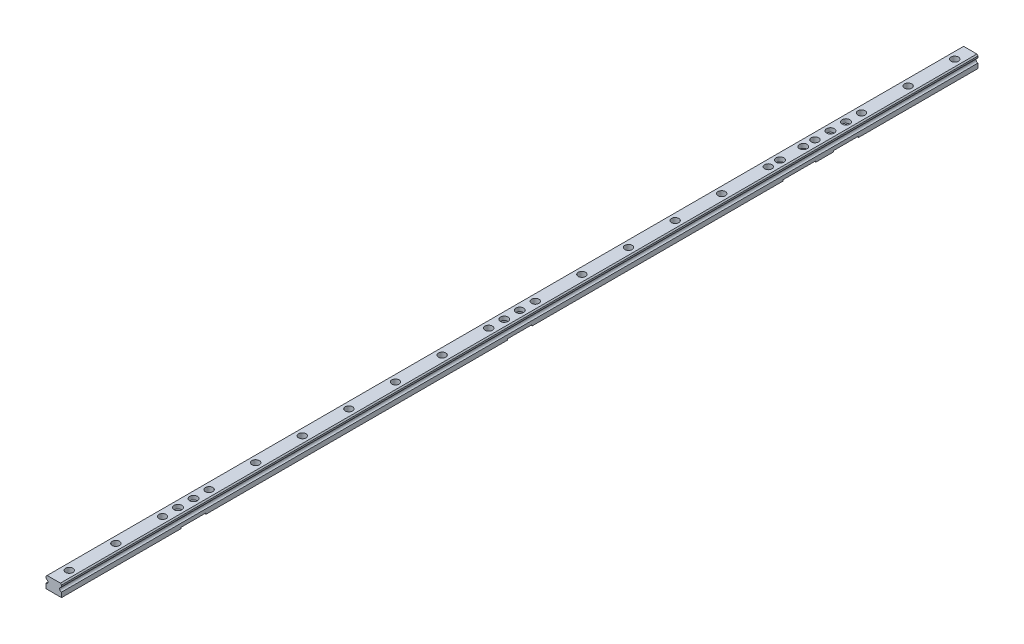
ISO-10303-21;
HEADER;
FILE_DESCRIPTION(('STEP AP214'),'2;1');
FILE_NAME('part.step','',(''),(''),'','','');
FILE_SCHEMA(('AUTOMOTIVE_DESIGN { 1 0 10303 214 1 1 1 1 }'));
ENDSEC;
DATA;
#1=APPLICATION_CONTEXT('core data for automotive mechanical design processes');
#2=APPLICATION_PROTOCOL_DEFINITION('international standard','automotive_design',2000,#1);
#3=PRODUCT_CONTEXT('',#1,'mechanical');
#4=PRODUCT('Part','Part','',(#3));
#5=PRODUCT_RELATED_PRODUCT_CATEGORY('part','',(#4));
#6=PRODUCT_DEFINITION_FORMATION('','',#4);
#7=PRODUCT_DEFINITION_CONTEXT('part definition',#1,'design');
#8=PRODUCT_DEFINITION('design','',#6,#7);
#9=PRODUCT_DEFINITION_SHAPE('','',#8);
#10=(LENGTH_UNIT() NAMED_UNIT(*) SI_UNIT(.MILLI.,.METRE.));
#11=(NAMED_UNIT(*) PLANE_ANGLE_UNIT() SI_UNIT($,.RADIAN.));
#12=(NAMED_UNIT(*) SI_UNIT($,.STERADIAN.) SOLID_ANGLE_UNIT());
#13=UNCERTAINTY_MEASURE_WITH_UNIT(LENGTH_MEASURE(1.E-05),#10,'distance_accuracy_value','');
#14=(GEOMETRIC_REPRESENTATION_CONTEXT(3) GLOBAL_UNCERTAINTY_ASSIGNED_CONTEXT((#13)) GLOBAL_UNIT_ASSIGNED_CONTEXT((#10,
#11,#12)) REPRESENTATION_CONTEXT('',''));
#15=CARTESIAN_POINT('',(0.,0.,0.));
#16=DIRECTION('',(0.,0.,1.));
#17=DIRECTION('',(1.,0.,0.));
#18=AXIS2_PLACEMENT_3D('',#15,#16,#17);
#19=CARTESIAN_POINT('',(8.54336003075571,15.5,200.));
#20=DIRECTION('',(0.,-1.,0.));
#21=DIRECTION('',(0.,0.,-1.));
#22=AXIS2_PLACEMENT_3D('',#19,#20,#21);
#23=PLANE('',#22);
#24=CARTESIAN_POINT('',(0.,15.5,120.));
#25=DIRECTION('',(0.,1.,0.));
#26=DIRECTION('',(0.,0.,1.));
#27=AXIS2_PLACEMENT_3D('',#24,#25,#26);
#28=CIRCLE('',#27,4.75);
#29=CARTESIAN_POINT('',(0.,15.5,124.75));
#30=VERTEX_POINT('',#29);
#31=EDGE_CURVE('E1881',#30,#30,#28,.T.);
#32=ORIENTED_EDGE('',*,*,#31,.F.);
#33=EDGE_LOOP('',(#32));
#34=FACE_BOUND('',#33,.T.);
#35=CARTESIAN_POINT('',(0.,15.5,-735.));
#36=DIRECTION('',(0.,1.,0.));
#37=DIRECTION('',(0.,0.,1.));
#38=AXIS2_PLACEMENT_3D('',#35,#36,#37);
#39=CIRCLE('',#38,4.99999999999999);
#40=CARTESIAN_POINT('',(0.,15.5,-730.));
#41=VERTEX_POINT('',#40);
#42=EDGE_CURVE('E1884',#41,#41,#39,.T.);
#43=ORIENTED_EDGE('',*,*,#42,.F.);
#44=EDGE_LOOP('',(#43));
#45=FACE_BOUND('',#44,.T.);
#46=CARTESIAN_POINT('',(0.,15.5,-765.));
#47=DIRECTION('',(0.,1.,0.));
#48=DIRECTION('',(0.,0.,1.));
#49=AXIS2_PLACEMENT_3D('',#46,#47,#48);
#50=CIRCLE('',#49,4.99999999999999);
#51=CARTESIAN_POINT('',(0.,15.5,-760.));
#52=VERTEX_POINT('',#51);
#53=EDGE_CURVE('E710',#52,#52,#50,.T.);
#54=ORIENTED_EDGE('',*,*,#53,.F.);
#55=EDGE_LOOP('',(#54));
#56=FACE_BOUND('',#55,.T.);
#57=CARTESIAN_POINT('',(0.,15.5,-800.));
#58=DIRECTION('',(0.,1.,0.));
#59=DIRECTION('',(0.,0.,1.));
#60=AXIS2_PLACEMENT_3D('',#57,#58,#59);
#61=CIRCLE('',#60,5.);
#62=CARTESIAN_POINT('',(0.,15.5,-795.));
#63=VERTEX_POINT('',#62);
#64=EDGE_CURVE('E257',#63,#63,#61,.T.);
#65=ORIENTED_EDGE('',*,*,#64,.F.);
#66=EDGE_LOOP('',(#65));
#67=FACE_BOUND('',#66,.T.);
#68=CARTESIAN_POINT('',(0.,15.5,-380.));
#69=DIRECTION('',(0.,1.,0.));
#70=DIRECTION('',(0.,0.,1.));
#71=AXIS2_PLACEMENT_3D('',#68,#69,#70);
#72=CIRCLE('',#71,5.);
#73=CARTESIAN_POINT('',(0.,15.5,-375.));
#74=VERTEX_POINT('',#73);
#75=EDGE_CURVE('E277',#74,#74,#72,.T.);
#76=ORIENTED_EDGE('',*,*,#75,.F.);
#77=EDGE_LOOP('',(#76));
#78=FACE_BOUND('',#77,.T.);
#79=CARTESIAN_POINT('',(0.,15.5,20.));
#80=DIRECTION('',(0.,1.,0.));
#81=DIRECTION('',(0.,0.,1.));
#82=AXIS2_PLACEMENT_3D('',#79,#80,#81);
#83=CIRCLE('',#82,5.);
#84=CARTESIAN_POINT('',(0.,15.5,25.));
#85=VERTEX_POINT('',#84);
#86=EDGE_CURVE('E321',#85,#85,#83,.T.);
#87=ORIENTED_EDGE('',*,*,#86,.F.);
#88=EDGE_LOOP('',(#87));
#89=FACE_BOUND('',#88,.T.);
#90=CARTESIAN_POINT('',(0.,15.5,40.));
#91=DIRECTION('',(0.,1.,0.));
#92=DIRECTION('',(0.,0.,1.));
#93=AXIS2_PLACEMENT_3D('',#90,#91,#92);
#94=CIRCLE('',#93,5.);
#95=CARTESIAN_POINT('',(0.,15.5,45.));
#96=VERTEX_POINT('',#95);
#97=EDGE_CURVE('E331',#96,#96,#94,.T.);
#98=ORIENTED_EDGE('',*,*,#97,.F.);
#99=EDGE_LOOP('',(#98));
#100=FACE_BOUND('',#99,.T.);
#101=CARTESIAN_POINT('',(0.,15.5,-900.));
#102=DIRECTION('',(0.,1.,0.));
#103=DIRECTION('',(0.,0.,1.));
#104=AXIS2_PLACEMENT_3D('',#101,#102,#103);
#105=CIRCLE('',#104,4.75);
#106=CARTESIAN_POINT('',(0.,15.5,-895.25));
#107=VERTEX_POINT('',#106);
#108=EDGE_CURVE('E379',#107,#107,#105,.T.);
#109=ORIENTED_EDGE('',*,*,#108,.F.);
#110=EDGE_LOOP('',(#109));
#111=FACE_BOUND('',#110,.T.);
#112=CARTESIAN_POINT('',(0.,15.5,-780.));
#113=DIRECTION('',(0.,1.,0.));
#114=DIRECTION('',(0.,0.,1.));
#115=AXIS2_PLACEMENT_3D('',#112,#113,#114);
#116=CIRCLE('',#115,4.75);
#117=CARTESIAN_POINT('',(0.,15.5,-775.25));
#118=VERTEX_POINT('',#117);
#119=EDGE_CURVE('E403',#118,#118,#116,.T.);
#120=ORIENTED_EDGE('',*,*,#119,.F.);
#121=EDGE_LOOP('',(#120));
#122=FACE_BOUND('',#121,.T.);
#123=CARTESIAN_POINT('',(0.,15.5,-660.));
#124=DIRECTION('',(0.,1.,0.));
#125=DIRECTION('',(0.,0.,1.));
#126=AXIS2_PLACEMENT_3D('',#123,#124,#125);
#127=CIRCLE('',#126,4.75);
#128=CARTESIAN_POINT('',(0.,15.5,-655.25));
#129=VERTEX_POINT('',#128);
#130=EDGE_CURVE('E427',#129,#129,#127,.T.);
#131=ORIENTED_EDGE('',*,*,#130,.F.);
#132=EDGE_LOOP('',(#131));
#133=FACE_BOUND('',#132,.T.);
#134=CARTESIAN_POINT('',(0.,15.5,-540.));
#135=DIRECTION('',(0.,1.,0.));
#136=DIRECTION('',(0.,0.,1.));
#137=AXIS2_PLACEMENT_3D('',#134,#135,#136);
#138=CIRCLE('',#137,4.75);
#139=CARTESIAN_POINT('',(0.,15.5,-535.25));
#140=VERTEX_POINT('',#139);
#141=EDGE_CURVE('E451',#140,#140,#138,.T.);
#142=ORIENTED_EDGE('',*,*,#141,.F.);
#143=EDGE_LOOP('',(#142));
#144=FACE_BOUND('',#143,.T.);
#145=CARTESIAN_POINT('',(0.,15.5,-420.));
#146=DIRECTION('',(0.,1.,0.));
#147=DIRECTION('',(0.,0.,1.));
#148=AXIS2_PLACEMENT_3D('',#145,#146,#147);
#149=CIRCLE('',#148,4.75);
#150=CARTESIAN_POINT('',(0.,15.5,-415.25));
#151=VERTEX_POINT('',#150);
#152=EDGE_CURVE('E475',#151,#151,#149,.T.);
#153=ORIENTED_EDGE('',*,*,#152,.F.);
#154=EDGE_LOOP('',(#153));
#155=FACE_BOUND('',#154,.T.);
#156=CARTESIAN_POINT('',(0.,15.5,-300.));
#157=DIRECTION('',(0.,1.,0.));
#158=DIRECTION('',(0.,0.,1.));
#159=AXIS2_PLACEMENT_3D('',#156,#157,#158);
#160=CIRCLE('',#159,4.75);
#161=CARTESIAN_POINT('',(0.,15.5,-295.25));
#162=VERTEX_POINT('',#161);
#163=EDGE_CURVE('E499',#162,#162,#160,.T.);
#164=ORIENTED_EDGE('',*,*,#163,.F.);
#165=EDGE_LOOP('',(#164));
#166=FACE_BOUND('',#165,.T.);
#167=CARTESIAN_POINT('',(0.,15.5,-180.));
#168=DIRECTION('',(0.,1.,0.));
#169=DIRECTION('',(0.,0.,1.));
#170=AXIS2_PLACEMENT_3D('',#167,#168,#169);
#171=CIRCLE('',#170,4.75);
#172=CARTESIAN_POINT('',(0.,15.5,-175.25));
#173=VERTEX_POINT('',#172);
#174=EDGE_CURVE('E523',#173,#173,#171,.T.);
#175=ORIENTED_EDGE('',*,*,#174,.F.);
#176=EDGE_LOOP('',(#175));
#177=FACE_BOUND('',#176,.T.);
#178=CARTESIAN_POINT('',(0.,15.5,0.));
#179=DIRECTION('',(0.,1.,0.));
#180=DIRECTION('',(0.,0.,1.));
#181=AXIS2_PLACEMENT_3D('',#178,#179,#180);
#182=CIRCLE('',#181,4.75);
#183=CARTESIAN_POINT('',(0.,15.5,4.75));
#184=VERTEX_POINT('',#183);
#185=EDGE_CURVE('E547',#184,#184,#182,.T.);
#186=ORIENTED_EDGE('',*,*,#185,.F.);
#187=EDGE_LOOP('',(#186));
#188=FACE_BOUND('',#187,.T.);
#189=CARTESIAN_POINT('',(0.,15.5,-60.));
#190=DIRECTION('',(0.,1.,0.));
#191=DIRECTION('',(0.,0.,1.));
#192=AXIS2_PLACEMENT_3D('',#189,#190,#191);
#193=CIRCLE('',#192,4.75);
#194=CARTESIAN_POINT('',(0.,15.5,-55.25));
#195=VERTEX_POINT('',#194);
#196=EDGE_CURVE('E571',#195,#195,#193,.T.);
#197=ORIENTED_EDGE('',*,*,#196,.F.);
#198=EDGE_LOOP('',(#197));
#199=FACE_BOUND('',#198,.T.);
#200=DIRECTION('',(0.,0.,-1.));
#201=VECTOR('',#200,1.);
#202=CARTESIAN_POINT('',(8.54336003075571,15.5,200.));
#203=LINE('',#202,#201);
#204=CARTESIAN_POINT('',(8.54336003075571,15.5,200.));
#205=VERTEX_POINT('',#204);
#206=CARTESIAN_POINT('',(8.54336003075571,15.5,-980.));
#207=VERTEX_POINT('',#206);
#208=EDGE_CURVE('E645',#205,#207,#203,.T.);
#209=ORIENTED_EDGE('',*,*,#208,.T.);
#210=DIRECTION('',(-1.,0.,0.));
#211=VECTOR('',#210,1.);
#212=CARTESIAN_POINT('',(8.54336003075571,15.5,-980.));
#213=LINE('',#212,#211);
#214=CARTESIAN_POINT('',(-8.54336003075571,15.5,-980.));
#215=VERTEX_POINT('',#214);
#216=EDGE_CURVE('E595',#207,#215,#213,.T.);
#217=ORIENTED_EDGE('',*,*,#216,.T.);
#218=DIRECTION('',(0.,0.,-1.));
#219=VECTOR('',#218,1.);
#220=CARTESIAN_POINT('',(-8.54336003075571,15.5,200.));
#221=LINE('',#220,#219);
#222=CARTESIAN_POINT('',(-8.54336003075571,15.5,200.));
#223=VERTEX_POINT('',#222);
#224=EDGE_CURVE('E643',#223,#215,#221,.T.);
#225=ORIENTED_EDGE('',*,*,#224,.F.);
#226=DIRECTION('',(-1.,0.,0.));
#227=VECTOR('',#226,1.);
#228=CARTESIAN_POINT('',(8.54336003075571,15.5,200.));
#229=LINE('',#228,#227);
#230=EDGE_CURVE('E625',#205,#223,#229,.T.);
#231=ORIENTED_EDGE('',*,*,#230,.F.);
#232=EDGE_LOOP('',(#209,#217,#225,#231));
#233=FACE_BOUND('',#232,.T.);
#234=CARTESIAN_POINT('',(0.,15.5,60.));
#235=DIRECTION('',(0.,1.,0.));
#236=DIRECTION('',(0.,0.,1.));
#237=AXIS2_PLACEMENT_3D('',#234,#235,#236);
#238=CIRCLE('',#237,4.75);
#239=CARTESIAN_POINT('',(0.,15.5,64.75));
#240=VERTEX_POINT('',#239);
#241=EDGE_CURVE('E559',#240,#240,#238,.T.);
#242=ORIENTED_EDGE('',*,*,#241,.F.);
#243=EDGE_LOOP('',(#242));
#244=FACE_BOUND('',#243,.T.);
#245=CARTESIAN_POINT('',(0.,15.5,-120.));
#246=DIRECTION('',(0.,1.,0.));
#247=DIRECTION('',(0.,0.,1.));
#248=AXIS2_PLACEMENT_3D('',#245,#246,#247);
#249=CIRCLE('',#248,4.75);
#250=CARTESIAN_POINT('',(0.,15.5,-115.25));
#251=VERTEX_POINT('',#250);
#252=EDGE_CURVE('E535',#251,#251,#249,.T.);
#253=ORIENTED_EDGE('',*,*,#252,.F.);
#254=EDGE_LOOP('',(#253));
#255=FACE_BOUND('',#254,.T.);
#256=CARTESIAN_POINT('',(0.,15.5,-240.));
#257=DIRECTION('',(0.,1.,0.));
#258=DIRECTION('',(0.,0.,1.));
#259=AXIS2_PLACEMENT_3D('',#256,#257,#258);
#260=CIRCLE('',#259,4.75);
#261=CARTESIAN_POINT('',(0.,15.5,-235.25));
#262=VERTEX_POINT('',#261);
#263=EDGE_CURVE('E511',#262,#262,#260,.T.);
#264=ORIENTED_EDGE('',*,*,#263,.F.);
#265=EDGE_LOOP('',(#264));
#266=FACE_BOUND('',#265,.T.);
#267=CARTESIAN_POINT('',(0.,15.5,-360.));
#268=DIRECTION('',(0.,1.,0.));
#269=DIRECTION('',(0.,0.,1.));
#270=AXIS2_PLACEMENT_3D('',#267,#268,#269);
#271=CIRCLE('',#270,4.75);
#272=CARTESIAN_POINT('',(0.,15.5,-355.25));
#273=VERTEX_POINT('',#272);
#274=EDGE_CURVE('E487',#273,#273,#271,.T.);
#275=ORIENTED_EDGE('',*,*,#274,.F.);
#276=EDGE_LOOP('',(#275));
#277=FACE_BOUND('',#276,.T.);
#278=CARTESIAN_POINT('',(0.,15.5,-480.));
#279=DIRECTION('',(0.,1.,0.));
#280=DIRECTION('',(0.,0.,1.));
#281=AXIS2_PLACEMENT_3D('',#278,#279,#280);
#282=CIRCLE('',#281,4.75);
#283=CARTESIAN_POINT('',(0.,15.5,-475.25));
#284=VERTEX_POINT('',#283);
#285=EDGE_CURVE('E463',#284,#284,#282,.T.);
#286=ORIENTED_EDGE('',*,*,#285,.F.);
#287=EDGE_LOOP('',(#286));
#288=FACE_BOUND('',#287,.T.);
#289=CARTESIAN_POINT('',(0.,15.5,-600.));
#290=DIRECTION('',(0.,1.,0.));
#291=DIRECTION('',(0.,0.,1.));
#292=AXIS2_PLACEMENT_3D('',#289,#290,#291);
#293=CIRCLE('',#292,4.75);
#294=CARTESIAN_POINT('',(0.,15.5,-595.25));
#295=VERTEX_POINT('',#294);
#296=EDGE_CURVE('E439',#295,#295,#293,.T.);
#297=ORIENTED_EDGE('',*,*,#296,.F.);
#298=EDGE_LOOP('',(#297));
#299=FACE_BOUND('',#298,.T.);
#300=CARTESIAN_POINT('',(0.,15.5,-720.));
#301=DIRECTION('',(0.,1.,0.));
#302=DIRECTION('',(0.,0.,1.));
#303=AXIS2_PLACEMENT_3D('',#300,#301,#302);
#304=CIRCLE('',#303,4.75);
#305=CARTESIAN_POINT('',(0.,15.5,-715.25));
#306=VERTEX_POINT('',#305);
#307=EDGE_CURVE('E415',#306,#306,#304,.T.);
#308=ORIENTED_EDGE('',*,*,#307,.F.);
#309=EDGE_LOOP('',(#308));
#310=FACE_BOUND('',#309,.T.);
#311=CARTESIAN_POINT('',(0.,15.5,-840.));
#312=DIRECTION('',(0.,1.,0.));
#313=DIRECTION('',(0.,0.,1.));
#314=AXIS2_PLACEMENT_3D('',#311,#312,#313);
#315=CIRCLE('',#314,4.75);
#316=CARTESIAN_POINT('',(0.,15.5,-835.25));
#317=VERTEX_POINT('',#316);
#318=EDGE_CURVE('E391',#317,#317,#315,.T.);
#319=ORIENTED_EDGE('',*,*,#318,.F.);
#320=EDGE_LOOP('',(#319));
#321=FACE_BOUND('',#320,.T.);
#322=CARTESIAN_POINT('',(0.,15.5,-960.));
#323=DIRECTION('',(0.,1.,0.));
#324=DIRECTION('',(0.,0.,1.));
#325=AXIS2_PLACEMENT_3D('',#322,#323,#324);
#326=CIRCLE('',#325,4.75);
#327=CARTESIAN_POINT('',(0.,15.5,-955.25));
#328=VERTEX_POINT('',#327);
#329=EDGE_CURVE('E367',#328,#328,#326,.T.);
#330=ORIENTED_EDGE('',*,*,#329,.F.);
#331=EDGE_LOOP('',(#330));
#332=FACE_BOUND('',#331,.T.);
#333=CARTESIAN_POINT('',(0.,15.5,-400.));
#334=DIRECTION('',(0.,1.,0.));
#335=DIRECTION('',(0.,0.,1.));
#336=AXIS2_PLACEMENT_3D('',#333,#334,#335);
#337=CIRCLE('',#336,5.);
#338=CARTESIAN_POINT('',(0.,15.5,-395.));
#339=VERTEX_POINT('',#338);
#340=EDGE_CURVE('E267',#339,#339,#337,.T.);
#341=ORIENTED_EDGE('',*,*,#340,.F.);
#342=EDGE_LOOP('',(#341));
#343=FACE_BOUND('',#342,.T.);
#344=CARTESIAN_POINT('',(0.,15.5,-820.));
#345=DIRECTION('',(0.,1.,0.));
#346=DIRECTION('',(0.,0.,1.));
#347=AXIS2_PLACEMENT_3D('',#344,#345,#346);
#348=CIRCLE('',#347,5.);
#349=CARTESIAN_POINT('',(0.,15.5,-815.));
#350=VERTEX_POINT('',#349);
#351=EDGE_CURVE('E246',#350,#350,#348,.T.);
#352=ORIENTED_EDGE('',*,*,#351,.F.);
#353=EDGE_LOOP('',(#352));
#354=FACE_BOUND('',#353,.T.);
#355=CARTESIAN_POINT('',(0.,15.5,180.));
#356=DIRECTION('',(0.,1.,0.));
#357=DIRECTION('',(0.,0.,1.));
#358=AXIS2_PLACEMENT_3D('',#355,#356,#357);
#359=CIRCLE('',#358,4.75);
#360=CARTESIAN_POINT('',(0.,15.5,184.75));
#361=VERTEX_POINT('',#360);
#362=EDGE_CURVE('E1869',#361,#361,#359,.T.);
#363=ORIENTED_EDGE('',*,*,#362,.F.);
#364=EDGE_LOOP('',(#363));
#365=FACE_BOUND('',#364,.T.);
#366=ADVANCED_FACE('F31',(#34,#45,#56,#67,#78,#89,#100,#111,#122,#133,#144,#155,#166,#177,#188,
#199,#233,#244,#255,#266,#277,#288,#299,#310,#321,#332,#343,#354,#365),#23,.F.);
#367=CARTESIAN_POINT('',(-10.,0.,200.));
#368=DIRECTION('',(0.,1.,0.));
#369=DIRECTION('',(0.,0.,1.));
#370=AXIS2_PLACEMENT_3D('',#367,#368,#369);
#371=PLANE('',#370);
#372=CARTESIAN_POINT('',(0.,0.,120.));
#373=DIRECTION('',(0.,1.,0.));
#374=DIRECTION('',(0.,0.,1.));
#375=AXIS2_PLACEMENT_3D('',#372,#373,#374);
#376=CIRCLE('',#375,3.);
#377=CARTESIAN_POINT('',(0.,0.,123.));
#378=VERTEX_POINT('',#377);
#379=EDGE_CURVE('E1872',#378,#378,#376,.T.);
#380=ORIENTED_EDGE('',*,*,#379,.T.);
#381=EDGE_LOOP('',(#380));
#382=FACE_BOUND('',#381,.T.);
#383=CARTESIAN_POINT('',(0.,0.,60.));
#384=DIRECTION('',(0.,1.,0.));
#385=DIRECTION('',(0.,0.,1.));
#386=AXIS2_PLACEMENT_3D('',#383,#384,#385);
#387=CIRCLE('',#386,3.);
#388=CARTESIAN_POINT('',(0.,0.,63.));
#389=VERTEX_POINT('',#388);
#390=EDGE_CURVE('E550',#389,#389,#387,.T.);
#391=ORIENTED_EDGE('',*,*,#390,.T.);
#392=EDGE_LOOP('',(#391));
#393=FACE_BOUND('',#392,.T.);
#394=DIRECTION('',(0.,0.,-1.));
#395=VECTOR('',#394,1.);
#396=CARTESIAN_POINT('',(-10.,0.,200.));
#397=LINE('',#396,#395);
#398=CARTESIAN_POINT('',(-10.,0.,200.));
#399=VERTEX_POINT('',#398);
#400=CARTESIAN_POINT('',(-10.,0.,46.));
#401=VERTEX_POINT('',#400);
#402=EDGE_CURVE('E662',#399,#401,#397,.T.);
#403=ORIENTED_EDGE('',*,*,#402,.T.);
#404=DIRECTION('',(-1.,0.,0.));
#405=VECTOR('',#404,1.);
#406=CARTESIAN_POINT('',(-15.,0.,46.));
#407=LINE('',#406,#405);
#408=CARTESIAN_POINT('',(10.,0.,46.));
#409=VERTEX_POINT('',#408);
#410=EDGE_CURVE('E344',#409,#401,#407,.T.);
#411=ORIENTED_EDGE('',*,*,#410,.F.);
#412=DIRECTION('',(0.,0.,-1.));
#413=VECTOR('',#412,1.);
#414=CARTESIAN_POINT('',(10.,0.,200.));
#415=LINE('',#414,#413);
#416=CARTESIAN_POINT('',(10.,0.,200.));
#417=VERTEX_POINT('',#416);
#418=EDGE_CURVE('E656',#417,#409,#415,.T.);
#419=ORIENTED_EDGE('',*,*,#418,.F.);
#420=DIRECTION('',(1.,0.,0.));
#421=VECTOR('',#420,1.);
#422=CARTESIAN_POINT('',(-10.,0.,200.));
#423=LINE('',#422,#421);
#424=EDGE_CURVE('E613',#399,#417,#423,.T.);
#425=ORIENTED_EDGE('',*,*,#424,.F.);
#426=EDGE_LOOP('',(#403,#411,#419,#425));
#427=FACE_BOUND('',#426,.T.);
#428=CARTESIAN_POINT('',(0.,0.,180.));
#429=DIRECTION('',(0.,1.,0.));
#430=DIRECTION('',(0.,0.,1.));
#431=AXIS2_PLACEMENT_3D('',#428,#429,#430);
#432=CIRCLE('',#431,3.);
#433=CARTESIAN_POINT('',(0.,0.,183.));
#434=VERTEX_POINT('',#433);
#435=EDGE_CURVE('E1861',#434,#434,#432,.T.);
#436=ORIENTED_EDGE('',*,*,#435,.T.);
#437=EDGE_LOOP('',(#436));
#438=FACE_BOUND('',#437,.T.);
#439=ADVANCED_FACE('F821',(#382,#393,#427,#438),#371,.F.);
#440=CARTESIAN_POINT('',(0.,0.,-780.));
#441=DIRECTION('',(0.,1.,0.));
#442=DIRECTION('',(0.,0.,1.));
#443=AXIS2_PLACEMENT_3D('',#440,#441,#442);
#444=CIRCLE('',#443,3.);
#445=CARTESIAN_POINT('',(0.,0.,-777.));
#446=VERTEX_POINT('',#445);
#447=EDGE_CURVE('E394',#446,#446,#444,.T.);
#448=ORIENTED_EDGE('',*,*,#447,.T.);
#449=EDGE_LOOP('',(#448));
#450=FACE_BOUND('',#449,.T.);
#451=CARTESIAN_POINT('',(10.,0.,-771.));
#452=VERTEX_POINT('',#451);
#453=CARTESIAN_POINT('',(10.,0.,-794.));
#454=VERTEX_POINT('',#453);
#455=EDGE_CURVE('E661',#452,#454,#415,.T.);
#456=ORIENTED_EDGE('',*,*,#455,.F.);
#457=DIRECTION('',(1.,0.,0.));
#458=VECTOR('',#457,1.);
#459=CARTESIAN_POINT('',(10.,0.,-771.));
#460=LINE('',#459,#458);
#461=CARTESIAN_POINT('',(-10.,0.,-771.));
#462=VERTEX_POINT('',#461);
#463=EDGE_CURVE('E233',#462,#452,#460,.T.);
#464=ORIENTED_EDGE('',*,*,#463,.F.);
#465=CARTESIAN_POINT('',(-10.,0.,-794.));
#466=VERTEX_POINT('',#465);
#467=EDGE_CURVE('E667',#462,#466,#397,.T.);
#468=ORIENTED_EDGE('',*,*,#467,.T.);
#469=DIRECTION('',(-1.,0.,0.));
#470=VECTOR('',#469,1.);
#471=CARTESIAN_POINT('',(-15.,0.,-794.));
#472=LINE('',#471,#470);
#473=EDGE_CURVE('E289',#454,#466,#472,.T.);
#474=ORIENTED_EDGE('',*,*,#473,.F.);
#475=EDGE_LOOP('',(#456,#464,#468,#474));
#476=FACE_BOUND('',#475,.T.);
#477=ADVANCED_FACE('F724',(#450,#476),#371,.F.);
#478=CARTESIAN_POINT('',(0.,0.,-720.));
#479=DIRECTION('',(0.,1.,0.));
#480=DIRECTION('',(0.,0.,1.));
#481=AXIS2_PLACEMENT_3D('',#478,#479,#480);
#482=CIRCLE('',#481,3.);
#483=CARTESIAN_POINT('',(0.,0.,-717.));
#484=VERTEX_POINT('',#483);
#485=EDGE_CURVE('E406',#484,#484,#482,.T.);
#486=ORIENTED_EDGE('',*,*,#485,.T.);
#487=EDGE_LOOP('',(#486));
#488=FACE_BOUND('',#487,.T.);
#489=CARTESIAN_POINT('',(0.,0.,-600.));
#490=DIRECTION('',(0.,1.,0.));
#491=DIRECTION('',(0.,0.,1.));
#492=AXIS2_PLACEMENT_3D('',#489,#490,#491);
#493=CIRCLE('',#492,3.);
#494=CARTESIAN_POINT('',(0.,0.,-597.));
#495=VERTEX_POINT('',#494);
#496=EDGE_CURVE('E430',#495,#495,#493,.T.);
#497=ORIENTED_EDGE('',*,*,#496,.T.);
#498=EDGE_LOOP('',(#497));
#499=FACE_BOUND('',#498,.T.);
#500=CARTESIAN_POINT('',(0.,0.,-480.));
#501=DIRECTION('',(0.,1.,0.));
#502=DIRECTION('',(0.,0.,1.));
#503=AXIS2_PLACEMENT_3D('',#500,#501,#502);
#504=CIRCLE('',#503,3.);
#505=CARTESIAN_POINT('',(0.,0.,-477.));
#506=VERTEX_POINT('',#505);
#507=EDGE_CURVE('E454',#506,#506,#504,.T.);
#508=ORIENTED_EDGE('',*,*,#507,.T.);
#509=EDGE_LOOP('',(#508));
#510=FACE_BOUND('',#509,.T.);
#511=CARTESIAN_POINT('',(0.,0.,-420.));
#512=DIRECTION('',(0.,1.,0.));
#513=DIRECTION('',(0.,0.,1.));
#514=AXIS2_PLACEMENT_3D('',#511,#512,#513);
#515=CIRCLE('',#514,3.);
#516=CARTESIAN_POINT('',(0.,0.,-417.));
#517=VERTEX_POINT('',#516);
#518=EDGE_CURVE('E466',#517,#517,#515,.T.);
#519=ORIENTED_EDGE('',*,*,#518,.T.);
#520=EDGE_LOOP('',(#519));
#521=FACE_BOUND('',#520,.T.);
#522=CARTESIAN_POINT('',(0.,0.,-540.));
#523=DIRECTION('',(0.,1.,0.));
#524=DIRECTION('',(0.,0.,1.));
#525=AXIS2_PLACEMENT_3D('',#522,#523,#524);
#526=CIRCLE('',#525,3.);
#527=CARTESIAN_POINT('',(0.,0.,-537.));
#528=VERTEX_POINT('',#527);
#529=EDGE_CURVE('E442',#528,#528,#526,.T.);
#530=ORIENTED_EDGE('',*,*,#529,.T.);
#531=EDGE_LOOP('',(#530));
#532=FACE_BOUND('',#531,.T.);
#533=CARTESIAN_POINT('',(0.,0.,-660.));
#534=DIRECTION('',(0.,1.,0.));
#535=DIRECTION('',(0.,0.,1.));
#536=AXIS2_PLACEMENT_3D('',#533,#534,#535);
#537=CIRCLE('',#536,3.);
#538=CARTESIAN_POINT('',(0.,0.,-657.));
#539=VERTEX_POINT('',#538);
#540=EDGE_CURVE('E418',#539,#539,#537,.T.);
#541=ORIENTED_EDGE('',*,*,#540,.T.);
#542=EDGE_LOOP('',(#541));
#543=FACE_BOUND('',#542,.T.);
#544=CARTESIAN_POINT('',(-10.,0.,-406.));
#545=VERTEX_POINT('',#544);
#546=CARTESIAN_POINT('',(-10.,0.,-729.));
#547=VERTEX_POINT('',#546);
#548=EDGE_CURVE('E727',#545,#547,#397,.T.);
#549=ORIENTED_EDGE('',*,*,#548,.T.);
#550=DIRECTION('',(-1.,0.,0.));
#551=VECTOR('',#550,1.);
#552=CARTESIAN_POINT('',(10.,0.,-729.));
#553=LINE('',#552,#551);
#554=CARTESIAN_POINT('',(10.,0.,-729.));
#555=VERTEX_POINT('',#554);
#556=EDGE_CURVE('E699',#555,#547,#553,.T.);
#557=ORIENTED_EDGE('',*,*,#556,.F.);
#558=CARTESIAN_POINT('',(10.,0.,-406.));
#559=VERTEX_POINT('',#558);
#560=EDGE_CURVE('E239',#559,#555,#415,.T.);
#561=ORIENTED_EDGE('',*,*,#560,.F.);
#562=DIRECTION('',(1.,0.,0.));
#563=VECTOR('',#562,1.);
#564=CARTESIAN_POINT('',(-15.,0.,-406.));
#565=LINE('',#564,#563);
#566=EDGE_CURVE('E304',#545,#559,#565,.T.);
#567=ORIENTED_EDGE('',*,*,#566,.F.);
#568=EDGE_LOOP('',(#549,#557,#561,#567));
#569=FACE_BOUND('',#568,.T.);
#570=ADVANCED_FACE('F813',(#488,#499,#510,#521,#532,#543,#569),#371,.F.);
#571=CARTESIAN_POINT('',(0.,0.,-360.));
#572=DIRECTION('',(0.,1.,0.));
#573=DIRECTION('',(0.,0.,1.));
#574=AXIS2_PLACEMENT_3D('',#571,#572,#573);
#575=CIRCLE('',#574,3.);
#576=CARTESIAN_POINT('',(0.,0.,-357.));
#577=VERTEX_POINT('',#576);
#578=EDGE_CURVE('E478',#577,#577,#575,.T.);
#579=ORIENTED_EDGE('',*,*,#578,.T.);
#580=EDGE_LOOP('',(#579));
#581=FACE_BOUND('',#580,.T.);
#582=CARTESIAN_POINT('',(0.,0.,-240.));
#583=DIRECTION('',(0.,1.,0.));
#584=DIRECTION('',(0.,0.,1.));
#585=AXIS2_PLACEMENT_3D('',#582,#583,#584);
#586=CIRCLE('',#585,3.);
#587=CARTESIAN_POINT('',(0.,0.,-237.));
#588=VERTEX_POINT('',#587);
#589=EDGE_CURVE('E502',#588,#588,#586,.T.);
#590=ORIENTED_EDGE('',*,*,#589,.T.);
#591=EDGE_LOOP('',(#590));
#592=FACE_BOUND('',#591,.T.);
#593=CARTESIAN_POINT('',(0.,0.,-120.));
#594=DIRECTION('',(0.,1.,0.));
#595=DIRECTION('',(0.,0.,1.));
#596=AXIS2_PLACEMENT_3D('',#593,#594,#595);
#597=CIRCLE('',#596,3.);
#598=CARTESIAN_POINT('',(0.,0.,-117.));
#599=VERTEX_POINT('',#598);
#600=EDGE_CURVE('E526',#599,#599,#597,.T.);
#601=ORIENTED_EDGE('',*,*,#600,.T.);
#602=EDGE_LOOP('',(#601));
#603=FACE_BOUND('',#602,.T.);
#604=CARTESIAN_POINT('',(0.,0.,-60.));
#605=DIRECTION('',(0.,1.,0.));
#606=DIRECTION('',(0.,0.,1.));
#607=AXIS2_PLACEMENT_3D('',#604,#605,#606);
#608=CIRCLE('',#607,3.);
#609=CARTESIAN_POINT('',(0.,0.,-57.));
#610=VERTEX_POINT('',#609);
#611=EDGE_CURVE('E562',#610,#610,#608,.T.);
#612=ORIENTED_EDGE('',*,*,#611,.T.);
#613=EDGE_LOOP('',(#612));
#614=FACE_BOUND('',#613,.T.);
#615=CARTESIAN_POINT('',(0.,0.,0.));
#616=DIRECTION('',(0.,1.,0.));
#617=DIRECTION('',(0.,0.,1.));
#618=AXIS2_PLACEMENT_3D('',#615,#616,#617);
#619=CIRCLE('',#618,3.);
#620=CARTESIAN_POINT('',(0.,0.,3.));
#621=VERTEX_POINT('',#620);
#622=EDGE_CURVE('E538',#621,#621,#619,.T.);
#623=ORIENTED_EDGE('',*,*,#622,.T.);
#624=EDGE_LOOP('',(#623));
#625=FACE_BOUND('',#624,.T.);
#626=CARTESIAN_POINT('',(0.,0.,-180.));
#627=DIRECTION('',(0.,1.,0.));
#628=DIRECTION('',(0.,0.,1.));
#629=AXIS2_PLACEMENT_3D('',#626,#627,#628);
#630=CIRCLE('',#629,3.);
#631=CARTESIAN_POINT('',(0.,0.,-177.));
#632=VERTEX_POINT('',#631);
#633=EDGE_CURVE('E514',#632,#632,#630,.T.);
#634=ORIENTED_EDGE('',*,*,#633,.T.);
#635=EDGE_LOOP('',(#634));
#636=FACE_BOUND('',#635,.T.);
#637=CARTESIAN_POINT('',(0.,0.,-300.));
#638=DIRECTION('',(0.,1.,0.));
#639=DIRECTION('',(0.,0.,1.));
#640=AXIS2_PLACEMENT_3D('',#637,#638,#639);
#641=CIRCLE('',#640,3.);
#642=CARTESIAN_POINT('',(0.,0.,-297.));
#643=VERTEX_POINT('',#642);
#644=EDGE_CURVE('E490',#643,#643,#641,.T.);
#645=ORIENTED_EDGE('',*,*,#644,.T.);
#646=EDGE_LOOP('',(#645));
#647=FACE_BOUND('',#646,.T.);
#648=CARTESIAN_POINT('',(-10.,0.,14.));
#649=VERTEX_POINT('',#648);
#650=CARTESIAN_POINT('',(-10.,0.,-374.));
#651=VERTEX_POINT('',#650);
#652=EDGE_CURVE('E666',#649,#651,#397,.T.);
#653=ORIENTED_EDGE('',*,*,#652,.T.);
#654=DIRECTION('',(-1.,0.,0.));
#655=VECTOR('',#654,1.);
#656=CARTESIAN_POINT('',(-15.,0.,-374.));
#657=LINE('',#656,#655);
#658=CARTESIAN_POINT('',(10.,0.,-374.));
#659=VERTEX_POINT('',#658);
#660=EDGE_CURVE('E308',#659,#651,#657,.T.);
#661=ORIENTED_EDGE('',*,*,#660,.F.);
#662=CARTESIAN_POINT('',(10.,0.,14.));
#663=VERTEX_POINT('',#662);
#664=EDGE_CURVE('E660',#663,#659,#415,.T.);
#665=ORIENTED_EDGE('',*,*,#664,.F.);
#666=DIRECTION('',(1.,0.,0.));
#667=VECTOR('',#666,1.);
#668=CARTESIAN_POINT('',(-15.,0.,14.));
#669=LINE('',#668,#667);
#670=EDGE_CURVE('E348',#649,#663,#669,.T.);
#671=ORIENTED_EDGE('',*,*,#670,.F.);
#672=EDGE_LOOP('',(#653,#661,#665,#671));
#673=FACE_BOUND('',#672,.T.);
#674=ADVANCED_FACE('F798',(#581,#592,#603,#614,#625,#636,#647,#673),#371,.F.);
#675=CARTESIAN_POINT('',(0.,0.,-900.));
#676=DIRECTION('',(0.,1.,0.));
#677=DIRECTION('',(0.,0.,1.));
#678=AXIS2_PLACEMENT_3D('',#675,#676,#677);
#679=CIRCLE('',#678,3.);
#680=CARTESIAN_POINT('',(0.,0.,-897.));
#681=VERTEX_POINT('',#680);
#682=EDGE_CURVE('E370',#681,#681,#679,.T.);
#683=ORIENTED_EDGE('',*,*,#682,.T.);
#684=EDGE_LOOP('',(#683));
#685=FACE_BOUND('',#684,.T.);
#686=CARTESIAN_POINT('',(10.,0.,-826.));
#687=VERTEX_POINT('',#686);
#688=CARTESIAN_POINT('',(10.,0.,-980.));
#689=VERTEX_POINT('',#688);
#690=EDGE_CURVE('E655',#687,#689,#415,.T.);
#691=ORIENTED_EDGE('',*,*,#690,.F.);
#692=DIRECTION('',(1.,0.,0.));
#693=VECTOR('',#692,1.);
#694=CARTESIAN_POINT('',(-15.,0.,-826.));
#695=LINE('',#694,#693);
#696=CARTESIAN_POINT('',(-10.,0.,-826.));
#697=VERTEX_POINT('',#696);
#698=EDGE_CURVE('E293',#697,#687,#695,.T.);
#699=ORIENTED_EDGE('',*,*,#698,.F.);
#700=CARTESIAN_POINT('',(-10.,0.,-980.));
#701=VERTEX_POINT('',#700);
#702=EDGE_CURVE('E659',#697,#701,#397,.T.);
#703=ORIENTED_EDGE('',*,*,#702,.T.);
#704=DIRECTION('',(1.,0.,0.));
#705=VECTOR('',#704,1.);
#706=CARTESIAN_POINT('',(-10.,0.,-980.));
#707=LINE('',#706,#705);
#708=EDGE_CURVE('E577',#701,#689,#707,.T.);
#709=ORIENTED_EDGE('',*,*,#708,.T.);
#710=EDGE_LOOP('',(#691,#699,#703,#709));
#711=FACE_BOUND('',#710,.T.);
#712=CARTESIAN_POINT('',(0.,0.,-840.));
#713=DIRECTION('',(0.,1.,0.));
#714=DIRECTION('',(0.,0.,1.));
#715=AXIS2_PLACEMENT_3D('',#712,#713,#714);
#716=CIRCLE('',#715,3.);
#717=CARTESIAN_POINT('',(0.,0.,-837.));
#718=VERTEX_POINT('',#717);
#719=EDGE_CURVE('E382',#718,#718,#716,.T.);
#720=ORIENTED_EDGE('',*,*,#719,.T.);
#721=EDGE_LOOP('',(#720));
#722=FACE_BOUND('',#721,.T.);
#723=CARTESIAN_POINT('',(0.,0.,-960.));
#724=DIRECTION('',(0.,1.,0.));
#725=DIRECTION('',(0.,0.,1.));
#726=AXIS2_PLACEMENT_3D('',#723,#724,#725);
#727=CIRCLE('',#726,3.);
#728=CARTESIAN_POINT('',(0.,0.,-957.));
#729=VERTEX_POINT('',#728);
#730=EDGE_CURVE('E358',#729,#729,#727,.T.);
#731=ORIENTED_EDGE('',*,*,#730,.T.);
#732=EDGE_LOOP('',(#731));
#733=FACE_BOUND('',#732,.T.);
#734=ADVANCED_FACE('F734',(#685,#711,#722,#733),#371,.F.);
#735=CARTESIAN_POINT('',(-10.,6.18,200.));
#736=DIRECTION('',(1.,0.,0.));
#737=DIRECTION('',(0.,0.,-1.));
#738=AXIS2_PLACEMENT_3D('',#735,#736,#737);
#739=PLANE('',#738);
#740=ORIENTED_EDGE('',*,*,#467,.F.);
#741=DIRECTION('',(0.,-1.,0.));
#742=VECTOR('',#741,1.);
#743=CARTESIAN_POINT('',(-10.,1.5,-771.));
#744=LINE('',#743,#742);
#745=CARTESIAN_POINT('',(-10.,1.5,-771.));
#746=VERTEX_POINT('',#745);
#747=EDGE_CURVE('E241',#746,#462,#744,.T.);
#748=ORIENTED_EDGE('',*,*,#747,.F.);
#749=DIRECTION('',(0.,0.,-1.));
#750=VECTOR('',#749,1.);
#751=CARTESIAN_POINT('',(-10.,1.5,-729.));
#752=LINE('',#751,#750);
#753=CARTESIAN_POINT('',(-10.,1.5,-729.));
#754=VERTEX_POINT('',#753);
#755=EDGE_CURVE('E226',#754,#746,#752,.T.);
#756=ORIENTED_EDGE('',*,*,#755,.F.);
#757=DIRECTION('',(0.,-1.,0.));
#758=VECTOR('',#757,1.);
#759=CARTESIAN_POINT('',(-10.,1.5,-729.));
#760=LINE('',#759,#758);
#761=EDGE_CURVE('E224',#754,#547,#760,.T.);
#762=ORIENTED_EDGE('',*,*,#761,.T.);
#763=ORIENTED_EDGE('',*,*,#548,.F.);
#764=DIRECTION('',(0.,1.,0.));
#765=VECTOR('',#764,1.);
#766=CARTESIAN_POINT('',(-10.,6.18,-406.));
#767=LINE('',#766,#765);
#768=CARTESIAN_POINT('',(-10.,1.5,-406.));
#769=VERTEX_POINT('',#768);
#770=EDGE_CURVE('E315',#545,#769,#767,.T.);
#771=ORIENTED_EDGE('',*,*,#770,.T.);
#772=DIRECTION('',(0.,0.,-1.));
#773=VECTOR('',#772,1.);
#774=CARTESIAN_POINT('',(-10.,1.5,200.));
#775=LINE('',#774,#773);
#776=CARTESIAN_POINT('',(-10.,1.5,-374.));
#777=VERTEX_POINT('',#776);
#778=EDGE_CURVE('E311',#777,#769,#775,.T.);
#779=ORIENTED_EDGE('',*,*,#778,.F.);
#780=DIRECTION('',(0.,-1.,0.));
#781=VECTOR('',#780,1.);
#782=CARTESIAN_POINT('',(-10.,6.18,-374.));
#783=LINE('',#782,#781);
#784=EDGE_CURVE('E318',#777,#651,#783,.T.);
#785=ORIENTED_EDGE('',*,*,#784,.T.);
#786=ORIENTED_EDGE('',*,*,#652,.F.);
#787=DIRECTION('',(0.,1.,0.));
#788=VECTOR('',#787,1.);
#789=CARTESIAN_POINT('',(-10.,6.18,14.));
#790=LINE('',#789,#788);
#791=CARTESIAN_POINT('',(-10.,1.5,14.));
#792=VERTEX_POINT('',#791);
#793=EDGE_CURVE('E352',#649,#792,#790,.T.);
#794=ORIENTED_EDGE('',*,*,#793,.T.);
#795=DIRECTION('',(0.,0.,-1.));
#796=VECTOR('',#795,1.);
#797=CARTESIAN_POINT('',(-10.,1.5,200.));
#798=LINE('',#797,#796);
#799=CARTESIAN_POINT('',(-10.,1.5,46.));
#800=VERTEX_POINT('',#799);
#801=EDGE_CURVE('E347',#800,#792,#798,.T.);
#802=ORIENTED_EDGE('',*,*,#801,.F.);
#803=DIRECTION('',(0.,-1.,0.));
#804=VECTOR('',#803,1.);
#805=CARTESIAN_POINT('',(-10.,6.18,46.));
#806=LINE('',#805,#804);
#807=EDGE_CURVE('E355',#800,#401,#806,.T.);
#808=ORIENTED_EDGE('',*,*,#807,.T.);
#809=ORIENTED_EDGE('',*,*,#402,.F.);
#810=DIRECTION('',(0.,-1.,0.));
#811=VECTOR('',#810,1.);
#812=CARTESIAN_POINT('',(-10.,6.18,200.));
#813=LINE('',#812,#811);
#814=CARTESIAN_POINT('',(-10.,6.18,200.));
#815=VERTEX_POINT('',#814);
#816=EDGE_CURVE('E610',#815,#399,#813,.T.);
#817=ORIENTED_EDGE('',*,*,#816,.F.);
#818=DIRECTION('',(0.,0.,-1.));
#819=VECTOR('',#818,1.);
#820=CARTESIAN_POINT('',(-10.,6.18,200.));
#821=LINE('',#820,#819);
#822=CARTESIAN_POINT('',(-10.,6.18,-980.));
#823=VERTEX_POINT('',#822);
#824=EDGE_CURVE('E635',#815,#823,#821,.T.);
#825=ORIENTED_EDGE('',*,*,#824,.T.);
#826=DIRECTION('',(0.,-1.,0.));
#827=VECTOR('',#826,1.);
#828=CARTESIAN_POINT('',(-10.,6.18,-980.));
#829=LINE('',#828,#827);
#830=EDGE_CURVE('E574',#823,#701,#829,.T.);
#831=ORIENTED_EDGE('',*,*,#830,.T.);
#832=ORIENTED_EDGE('',*,*,#702,.F.);
#833=DIRECTION('',(0.,1.,0.));
#834=VECTOR('',#833,1.);
#835=CARTESIAN_POINT('',(-10.,6.18,-826.));
#836=LINE('',#835,#834);
#837=CARTESIAN_POINT('',(-10.,1.5,-826.));
#838=VERTEX_POINT('',#837);
#839=EDGE_CURVE('E298',#697,#838,#836,.T.);
#840=ORIENTED_EDGE('',*,*,#839,.T.);
#841=DIRECTION('',(0.,0.,-1.));
#842=VECTOR('',#841,1.);
#843=CARTESIAN_POINT('',(-10.,1.5,200.));
#844=LINE('',#843,#842);
#845=CARTESIAN_POINT('',(-10.,1.5,-794.));
#846=VERTEX_POINT('',#845);
#847=EDGE_CURVE('E292',#846,#838,#844,.T.);
#848=ORIENTED_EDGE('',*,*,#847,.F.);
#849=DIRECTION('',(0.,-1.,0.));
#850=VECTOR('',#849,1.);
#851=CARTESIAN_POINT('',(-10.,6.18,-794.));
#852=LINE('',#851,#850);
#853=EDGE_CURVE('E301',#846,#466,#852,.T.);
#854=ORIENTED_EDGE('',*,*,#853,.T.);
#855=EDGE_LOOP('',(#740,#748,#756,#762,#763,#771,#779,#785,#786,#794,#802,#808,#809,#817,#825,
#831,#832,#840,#848,#854));
#856=FACE_BOUND('',#855,.T.);
#857=ADVANCED_FACE('F33',(#856),#739,.F.);
#858=CARTESIAN_POINT('',(10.,0.,200.));
#859=DIRECTION('',(-1.,0.,0.));
#860=DIRECTION('',(0.,0.,1.));
#861=AXIS2_PLACEMENT_3D('',#858,#859,#860);
#862=PLANE('',#861);
#863=DIRECTION('',(0.,0.,1.));
#864=VECTOR('',#863,1.);
#865=CARTESIAN_POINT('',(10.,1.5,-729.));
#866=LINE('',#865,#864);
#867=CARTESIAN_POINT('',(10.,1.5,-771.));
#868=VERTEX_POINT('',#867);
#869=CARTESIAN_POINT('',(10.,1.5,-729.));
#870=VERTEX_POINT('',#869);
#871=EDGE_CURVE('E227',#868,#870,#866,.T.);
#872=ORIENTED_EDGE('',*,*,#871,.F.);
#873=DIRECTION('',(0.,-1.,0.));
#874=VECTOR('',#873,1.);
#875=CARTESIAN_POINT('',(10.,1.5,-771.));
#876=LINE('',#875,#874);
#877=EDGE_CURVE('E250',#868,#452,#876,.T.);
#878=ORIENTED_EDGE('',*,*,#877,.T.);
#879=ORIENTED_EDGE('',*,*,#455,.T.);
#880=DIRECTION('',(0.,1.,0.));
#881=VECTOR('',#880,1.);
#882=CARTESIAN_POINT('',(10.,0.,-794.));
#883=LINE('',#882,#881);
#884=CARTESIAN_POINT('',(10.,1.5,-794.));
#885=VERTEX_POINT('',#884);
#886=EDGE_CURVE('E11',#454,#885,#883,.T.);
#887=ORIENTED_EDGE('',*,*,#886,.T.);
#888=DIRECTION('',(0.,0.,1.));
#889=VECTOR('',#888,1.);
#890=CARTESIAN_POINT('',(10.,1.5,200.));
#891=LINE('',#890,#889);
#892=CARTESIAN_POINT('',(10.,1.5,-826.));
#893=VERTEX_POINT('',#892);
#894=EDGE_CURVE('E686',#893,#885,#891,.T.);
#895=ORIENTED_EDGE('',*,*,#894,.F.);
#896=DIRECTION('',(0.,-1.,0.));
#897=VECTOR('',#896,1.);
#898=CARTESIAN_POINT('',(10.,0.,-826.));
#899=LINE('',#898,#897);
#900=EDGE_CURVE('E40',#893,#687,#899,.T.);
#901=ORIENTED_EDGE('',*,*,#900,.T.);
#902=ORIENTED_EDGE('',*,*,#690,.T.);
#903=DIRECTION('',(0.,1.,0.));
#904=VECTOR('',#903,1.);
#905=CARTESIAN_POINT('',(10.,0.,-980.));
#906=LINE('',#905,#904);
#907=CARTESIAN_POINT('',(10.,6.18,-980.));
#908=VERTEX_POINT('',#907);
#909=EDGE_CURVE('E580',#689,#908,#906,.T.);
#910=ORIENTED_EDGE('',*,*,#909,.T.);
#911=DIRECTION('',(0.,0.,-1.));
#912=VECTOR('',#911,1.);
#913=CARTESIAN_POINT('',(10.,6.18,200.));
#914=LINE('',#913,#912);
#915=CARTESIAN_POINT('',(10.,6.18,200.));
#916=VERTEX_POINT('',#915);
#917=EDGE_CURVE('E653',#916,#908,#914,.T.);
#918=ORIENTED_EDGE('',*,*,#917,.F.);
#919=DIRECTION('',(0.,1.,0.));
#920=VECTOR('',#919,1.);
#921=CARTESIAN_POINT('',(10.,0.,200.));
#922=LINE('',#921,#920);
#923=EDGE_CURVE('E615',#417,#916,#922,.T.);
#924=ORIENTED_EDGE('',*,*,#923,.F.);
#925=ORIENTED_EDGE('',*,*,#418,.T.);
#926=DIRECTION('',(0.,1.,0.));
#927=VECTOR('',#926,1.);
#928=CARTESIAN_POINT('',(10.,0.,46.));
#929=LINE('',#928,#927);
#930=CARTESIAN_POINT('',(10.,1.5,46.));
#931=VERTEX_POINT('',#930);
#932=EDGE_CURVE('E672',#409,#931,#929,.T.);
#933=ORIENTED_EDGE('',*,*,#932,.T.);
#934=DIRECTION('',(0.,0.,1.));
#935=VECTOR('',#934,1.);
#936=CARTESIAN_POINT('',(10.,1.5,200.));
#937=LINE('',#936,#935);
#938=CARTESIAN_POINT('',(10.,1.5,14.));
#939=VERTEX_POINT('',#938);
#940=EDGE_CURVE('E665',#939,#931,#937,.T.);
#941=ORIENTED_EDGE('',*,*,#940,.F.);
#942=DIRECTION('',(0.,-1.,0.));
#943=VECTOR('',#942,1.);
#944=CARTESIAN_POINT('',(10.,0.,14.));
#945=LINE('',#944,#943);
#946=EDGE_CURVE('E669',#939,#663,#945,.T.);
#947=ORIENTED_EDGE('',*,*,#946,.T.);
#948=ORIENTED_EDGE('',*,*,#664,.T.);
#949=DIRECTION('',(0.,1.,0.));
#950=VECTOR('',#949,1.);
#951=CARTESIAN_POINT('',(10.,0.,-374.));
#952=LINE('',#951,#950);
#953=CARTESIAN_POINT('',(10.,1.5,-374.));
#954=VERTEX_POINT('',#953);
#955=EDGE_CURVE('E683',#659,#954,#952,.T.);
#956=ORIENTED_EDGE('',*,*,#955,.T.);
#957=DIRECTION('',(0.,0.,1.));
#958=VECTOR('',#957,1.);
#959=CARTESIAN_POINT('',(10.,1.5,200.));
#960=LINE('',#959,#958);
#961=CARTESIAN_POINT('',(10.,1.5,-406.));
#962=VERTEX_POINT('',#961);
#963=EDGE_CURVE('E675',#962,#954,#960,.T.);
#964=ORIENTED_EDGE('',*,*,#963,.F.);
#965=DIRECTION('',(0.,-1.,0.));
#966=VECTOR('',#965,1.);
#967=CARTESIAN_POINT('',(10.,0.,-406.));
#968=LINE('',#967,#966);
#969=EDGE_CURVE('E681',#962,#559,#968,.T.);
#970=ORIENTED_EDGE('',*,*,#969,.T.);
#971=ORIENTED_EDGE('',*,*,#560,.T.);
#972=DIRECTION('',(0.,-1.,0.));
#973=VECTOR('',#972,1.);
#974=CARTESIAN_POINT('',(10.,1.5,-729.));
#975=LINE('',#974,#973);
#976=EDGE_CURVE('E221',#870,#555,#975,.T.);
#977=ORIENTED_EDGE('',*,*,#976,.F.);
#978=EDGE_LOOP('',(#872,#878,#879,#887,#895,#901,#902,#910,#918,#924,#925,#933,#941,#947,#948,
#956,#964,#970,#971,#977));
#979=FACE_BOUND('',#978,.T.);
#980=ADVANCED_FACE('F236',(#979),#862,.F.);
#981=CARTESIAN_POINT('',(10.,8.68,200.));
#982=DIRECTION('',(0.,0.,-1.));
#983=DIRECTION('',(-1.,0.,0.));
#984=AXIS2_PLACEMENT_3D('',#981,#982,#983);
#985=CYLINDRICAL_SURFACE('',#984,2.5);
#986=ORIENTED_EDGE('',*,*,#917,.T.);
#987=CARTESIAN_POINT('',(10.,8.68,-980.));
#988=DIRECTION('',(0.,0.,-1.));
#989=DIRECTION('',(-1.,0.,0.));
#990=AXIS2_PLACEMENT_3D('',#987,#988,#989);
#991=CIRCLE('',#990,2.5);
#992=CARTESIAN_POINT('',(9.0625,10.9975620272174,-980.));
#993=VERTEX_POINT('',#992);
#994=EDGE_CURVE('E583',#908,#993,#991,.T.);
#995=ORIENTED_EDGE('',*,*,#994,.T.);
#996=DIRECTION('',(0.,0.,-1.));
#997=VECTOR('',#996,1.);
#998=CARTESIAN_POINT('',(9.0625,10.9975620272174,200.));
#999=LINE('',#998,#997);
#1000=CARTESIAN_POINT('',(9.0625,10.9975620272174,200.));
#1001=VERTEX_POINT('',#1000);
#1002=EDGE_CURVE('E651',#1001,#993,#999,.T.);
#1003=ORIENTED_EDGE('',*,*,#1002,.F.);
#1004=CARTESIAN_POINT('',(10.,8.68,200.));
#1005=DIRECTION('',(0.,0.,-1.));
#1006=DIRECTION('',(-1.,0.,0.));
#1007=AXIS2_PLACEMENT_3D('',#1004,#1005,#1006);
#1008=CIRCLE('',#1007,2.5);
#1009=EDGE_CURVE('E617',#916,#1001,#1008,.T.);
#1010=ORIENTED_EDGE('',*,*,#1009,.F.);
#1011=EDGE_LOOP('',(#986,#995,#1003,#1010));
#1012=FACE_BOUND('',#1011,.T.);
#1013=ADVANCED_FACE('F784',(#1012),#985,.F.);
#1014=CARTESIAN_POINT('',(8.5,12.3880992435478,200.));
#1015=DIRECTION('',(0.,0.,-1.));
#1016=DIRECTION('',(-1.,0.,0.));
#1017=AXIS2_PLACEMENT_3D('',#1014,#1015,#1016);
#1018=CYLINDRICAL_SURFACE('',#1017,1.5);
#1019=ORIENTED_EDGE('',*,*,#1002,.T.);
#1020=CARTESIAN_POINT('',(8.5,12.3880992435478,-980.));
#1021=DIRECTION('',(0.,0.,1.));
#1022=DIRECTION('',(1.,0.,0.));
#1023=AXIS2_PLACEMENT_3D('',#1020,#1021,#1022);
#1024=CIRCLE('',#1023,1.5);
#1025=CARTESIAN_POINT('',(10.,12.3880992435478,-980.));
#1026=VERTEX_POINT('',#1025);
#1027=EDGE_CURVE('E586',#993,#1026,#1024,.T.);
#1028=ORIENTED_EDGE('',*,*,#1027,.T.);
#1029=DIRECTION('',(0.,0.,-1.));
#1030=VECTOR('',#1029,1.);
#1031=CARTESIAN_POINT('',(10.,12.3880992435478,200.));
#1032=LINE('',#1031,#1030);
#1033=CARTESIAN_POINT('',(10.,12.3880992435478,200.));
#1034=VERTEX_POINT('',#1033);
#1035=EDGE_CURVE('E649',#1034,#1026,#1032,.T.);
#1036=ORIENTED_EDGE('',*,*,#1035,.F.);
#1037=CARTESIAN_POINT('',(8.5,12.3880992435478,200.));
#1038=DIRECTION('',(0.,0.,1.));
#1039=DIRECTION('',(1.,0.,0.));
#1040=AXIS2_PLACEMENT_3D('',#1037,#1038,#1039);
#1041=CIRCLE('',#1040,1.5);
#1042=EDGE_CURVE('E619',#1001,#1034,#1041,.T.);
#1043=ORIENTED_EDGE('',*,*,#1042,.F.);
#1044=EDGE_LOOP('',(#1019,#1028,#1036,#1043));
#1045=FACE_BOUND('',#1044,.T.);
#1046=ADVANCED_FACE('F781',(#1045),#1018,.T.);
#1047=CARTESIAN_POINT('',(10.,12.3880992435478,200.));
#1048=DIRECTION('',(-1.,0.,0.));
#1049=DIRECTION('',(0.,0.,1.));
#1050=AXIS2_PLACEMENT_3D('',#1047,#1048,#1049);
#1051=PLANE('',#1050);
#1052=ORIENTED_EDGE('',*,*,#1035,.T.);
#1053=DIRECTION('',(0.,1.,0.));
#1054=VECTOR('',#1053,1.);
#1055=CARTESIAN_POINT('',(10.,12.3880992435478,-980.));
#1056=LINE('',#1055,#1054);
#1057=CARTESIAN_POINT('',(10.,14.0433600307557,-980.));
#1058=VERTEX_POINT('',#1057);
#1059=EDGE_CURVE('E589',#1026,#1058,#1056,.T.);
#1060=ORIENTED_EDGE('',*,*,#1059,.T.);
#1061=DIRECTION('',(0.,0.,-1.));
#1062=VECTOR('',#1061,1.);
#1063=CARTESIAN_POINT('',(10.,14.0433600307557,200.));
#1064=LINE('',#1063,#1062);
#1065=CARTESIAN_POINT('',(10.,14.0433600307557,200.));
#1066=VERTEX_POINT('',#1065);
#1067=EDGE_CURVE('E647',#1066,#1058,#1064,.T.);
#1068=ORIENTED_EDGE('',*,*,#1067,.F.);
#1069=DIRECTION('',(0.,1.,0.));
#1070=VECTOR('',#1069,1.);
#1071=CARTESIAN_POINT('',(10.,12.3880992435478,200.));
#1072=LINE('',#1071,#1070);
#1073=EDGE_CURVE('E621',#1034,#1066,#1072,.T.);
#1074=ORIENTED_EDGE('',*,*,#1073,.F.);
#1075=EDGE_LOOP('',(#1052,#1060,#1068,#1074));
#1076=FACE_BOUND('',#1075,.T.);
#1077=ADVANCED_FACE('F776',(#1076),#1051,.F.);
#1078=CARTESIAN_POINT('',(10.,14.0433600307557,200.));
#1079=DIRECTION('',(-0.707106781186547,-0.707106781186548,0.));
#1080=DIRECTION('',(0.707106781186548,-0.707106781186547,0.));
#1081=AXIS2_PLACEMENT_3D('',#1078,#1079,#1080);
#1082=PLANE('',#1081);
#1083=ORIENTED_EDGE('',*,*,#1067,.T.);
#1084=DIRECTION('',(-0.707106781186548,0.707106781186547,0.));
#1085=VECTOR('',#1084,1.);
#1086=CARTESIAN_POINT('',(10.,14.0433600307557,-980.));
#1087=LINE('',#1086,#1085);
#1088=EDGE_CURVE('E592',#1058,#207,#1087,.T.);
#1089=ORIENTED_EDGE('',*,*,#1088,.T.);
#1090=ORIENTED_EDGE('',*,*,#208,.F.);
#1091=DIRECTION('',(-0.707106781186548,0.707106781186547,0.));
#1092=VECTOR('',#1091,1.);
#1093=CARTESIAN_POINT('',(10.,14.0433600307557,200.));
#1094=LINE('',#1093,#1092);
#1095=EDGE_CURVE('E623',#1066,#205,#1094,.T.);
#1096=ORIENTED_EDGE('',*,*,#1095,.F.);
#1097=EDGE_LOOP('',(#1083,#1089,#1090,#1096));
#1098=FACE_BOUND('',#1097,.T.);
#1099=ADVANCED_FACE('F771',(#1098),#1082,.F.);
#1100=CARTESIAN_POINT('',(-8.54336003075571,15.5,200.));
#1101=DIRECTION('',(0.707106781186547,-0.707106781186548,0.));
#1102=DIRECTION('',(0.707106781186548,0.707106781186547,0.));
#1103=AXIS2_PLACEMENT_3D('',#1100,#1101,#1102);
#1104=PLANE('',#1103);
#1105=ORIENTED_EDGE('',*,*,#224,.T.);
#1106=DIRECTION('',(-0.707106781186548,-0.707106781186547,0.));
#1107=VECTOR('',#1106,1.);
#1108=CARTESIAN_POINT('',(-8.54336003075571,15.5,-980.));
#1109=LINE('',#1108,#1107);
#1110=CARTESIAN_POINT('',(-10.,14.0433600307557,-980.));
#1111=VERTEX_POINT('',#1110);
#1112=EDGE_CURVE('E598',#215,#1111,#1109,.T.);
#1113=ORIENTED_EDGE('',*,*,#1112,.T.);
#1114=DIRECTION('',(0.,0.,-1.));
#1115=VECTOR('',#1114,1.);
#1116=CARTESIAN_POINT('',(-10.,14.0433600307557,200.));
#1117=LINE('',#1116,#1115);
#1118=CARTESIAN_POINT('',(-10.,14.0433600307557,200.));
#1119=VERTEX_POINT('',#1118);
#1120=EDGE_CURVE('E641',#1119,#1111,#1117,.T.);
#1121=ORIENTED_EDGE('',*,*,#1120,.F.);
#1122=DIRECTION('',(-0.707106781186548,-0.707106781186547,0.));
#1123=VECTOR('',#1122,1.);
#1124=CARTESIAN_POINT('',(-8.54336003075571,15.5,200.));
#1125=LINE('',#1124,#1123);
#1126=EDGE_CURVE('E627',#223,#1119,#1125,.T.);
#1127=ORIENTED_EDGE('',*,*,#1126,.F.);
#1128=EDGE_LOOP('',(#1105,#1113,#1121,#1127));
#1129=FACE_BOUND('',#1128,.T.);
#1130=ADVANCED_FACE('F761',(#1129),#1104,.F.);
#1131=CARTESIAN_POINT('',(-10.,14.0433600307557,200.));
#1132=DIRECTION('',(1.,0.,0.));
#1133=DIRECTION('',(0.,0.,-1.));
#1134=AXIS2_PLACEMENT_3D('',#1131,#1132,#1133);
#1135=PLANE('',#1134);
#1136=ORIENTED_EDGE('',*,*,#1120,.T.);
#1137=DIRECTION('',(0.,-1.,0.));
#1138=VECTOR('',#1137,1.);
#1139=CARTESIAN_POINT('',(-10.,14.0433600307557,-980.));
#1140=LINE('',#1139,#1138);
#1141=CARTESIAN_POINT('',(-10.,12.3880992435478,-980.));
#1142=VERTEX_POINT('',#1141);
#1143=EDGE_CURVE('E601',#1111,#1142,#1140,.T.);
#1144=ORIENTED_EDGE('',*,*,#1143,.T.);
#1145=DIRECTION('',(0.,0.,-1.));
#1146=VECTOR('',#1145,1.);
#1147=CARTESIAN_POINT('',(-10.,12.3880992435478,200.));
#1148=LINE('',#1147,#1146);
#1149=CARTESIAN_POINT('',(-10.,12.3880992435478,200.));
#1150=VERTEX_POINT('',#1149);
#1151=EDGE_CURVE('E639',#1150,#1142,#1148,.T.);
#1152=ORIENTED_EDGE('',*,*,#1151,.F.);
#1153=DIRECTION('',(0.,-1.,0.));
#1154=VECTOR('',#1153,1.);
#1155=CARTESIAN_POINT('',(-10.,14.0433600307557,200.));
#1156=LINE('',#1155,#1154);
#1157=EDGE_CURVE('E629',#1119,#1150,#1156,.T.);
#1158=ORIENTED_EDGE('',*,*,#1157,.F.);
#1159=EDGE_LOOP('',(#1136,#1144,#1152,#1158));
#1160=FACE_BOUND('',#1159,.T.);
#1161=ADVANCED_FACE('F755',(#1160),#1135,.F.);
#1162=CARTESIAN_POINT('',(-8.5,12.3880992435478,200.));
#1163=DIRECTION('',(0.,0.,-1.));
#1164=DIRECTION('',(-1.,0.,0.));
#1165=AXIS2_PLACEMENT_3D('',#1162,#1163,#1164);
#1166=CYLINDRICAL_SURFACE('',#1165,1.5);
#1167=ORIENTED_EDGE('',*,*,#1151,.T.);
#1168=CARTESIAN_POINT('',(-8.5,12.3880992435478,-980.));
#1169=DIRECTION('',(0.,0.,1.));
#1170=DIRECTION('',(1.,0.,0.));
#1171=AXIS2_PLACEMENT_3D('',#1168,#1169,#1170);
#1172=CIRCLE('',#1171,1.5);
#1173=CARTESIAN_POINT('',(-9.0625,10.9975620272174,-980.));
#1174=VERTEX_POINT('',#1173);
#1175=EDGE_CURVE('E604',#1142,#1174,#1172,.T.);
#1176=ORIENTED_EDGE('',*,*,#1175,.T.);
#1177=DIRECTION('',(0.,0.,-1.));
#1178=VECTOR('',#1177,1.);
#1179=CARTESIAN_POINT('',(-9.0625,10.9975620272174,200.));
#1180=LINE('',#1179,#1178);
#1181=CARTESIAN_POINT('',(-9.0625,10.9975620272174,200.));
#1182=VERTEX_POINT('',#1181);
#1183=EDGE_CURVE('E637',#1182,#1174,#1180,.T.);
#1184=ORIENTED_EDGE('',*,*,#1183,.F.);
#1185=CARTESIAN_POINT('',(-8.5,12.3880992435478,200.));
#1186=DIRECTION('',(0.,0.,1.));
#1187=DIRECTION('',(1.,0.,0.));
#1188=AXIS2_PLACEMENT_3D('',#1185,#1186,#1187);
#1189=CIRCLE('',#1188,1.5);
#1190=EDGE_CURVE('E631',#1150,#1182,#1189,.T.);
#1191=ORIENTED_EDGE('',*,*,#1190,.F.);
#1192=EDGE_LOOP('',(#1167,#1176,#1184,#1191));
#1193=FACE_BOUND('',#1192,.T.);
#1194=ADVANCED_FACE('F1077',(#1193),#1166,.T.);
#1195=CARTESIAN_POINT('',(-10.,8.68,200.));
#1196=DIRECTION('',(0.,0.,-1.));
#1197=DIRECTION('',(-1.,0.,0.));
#1198=AXIS2_PLACEMENT_3D('',#1195,#1196,#1197);
#1199=CYLINDRICAL_SURFACE('',#1198,2.5);
#1200=ORIENTED_EDGE('',*,*,#1183,.T.);
#1201=CARTESIAN_POINT('',(-10.,8.68,-980.));
#1202=DIRECTION('',(0.,0.,-1.));
#1203=DIRECTION('',(-1.,0.,0.));
#1204=AXIS2_PLACEMENT_3D('',#1201,#1202,#1203);
#1205=CIRCLE('',#1204,2.5);
#1206=EDGE_CURVE('E607',#1174,#823,#1205,.T.);
#1207=ORIENTED_EDGE('',*,*,#1206,.T.);
#1208=ORIENTED_EDGE('',*,*,#824,.F.);
#1209=CARTESIAN_POINT('',(-10.,8.68,200.));
#1210=DIRECTION('',(0.,0.,-1.));
#1211=DIRECTION('',(-1.,0.,0.));
#1212=AXIS2_PLACEMENT_3D('',#1209,#1210,#1211);
#1213=CIRCLE('',#1212,2.5);
#1214=EDGE_CURVE('E633',#1182,#815,#1213,.T.);
#1215=ORIENTED_EDGE('',*,*,#1214,.F.);
#1216=EDGE_LOOP('',(#1200,#1207,#1208,#1215));
#1217=FACE_BOUND('',#1216,.T.);
#1218=ADVANCED_FACE('F747',(#1217),#1199,.F.);
#1219=CARTESIAN_POINT('',(10.,8.68,200.));
#1220=DIRECTION('',(0.,0.,-1.));
#1221=DIRECTION('',(-1.,0.,0.));
#1222=AXIS2_PLACEMENT_3D('',#1219,#1220,#1221);
#1223=PLANE('',#1222);
#1224=ORIENTED_EDGE('',*,*,#816,.T.);
#1225=ORIENTED_EDGE('',*,*,#424,.T.);
#1226=ORIENTED_EDGE('',*,*,#923,.T.);
#1227=ORIENTED_EDGE('',*,*,#1009,.T.);
#1228=ORIENTED_EDGE('',*,*,#1042,.T.);
#1229=ORIENTED_EDGE('',*,*,#1073,.T.);
#1230=ORIENTED_EDGE('',*,*,#1095,.T.);
#1231=ORIENTED_EDGE('',*,*,#230,.T.);
#1232=ORIENTED_EDGE('',*,*,#1126,.T.);
#1233=ORIENTED_EDGE('',*,*,#1157,.T.);
#1234=ORIENTED_EDGE('',*,*,#1190,.T.);
#1235=ORIENTED_EDGE('',*,*,#1214,.T.);
#1236=EDGE_LOOP('',(#1224,#1225,#1226,#1227,#1228,#1229,#1230,#1231,#1232,#1233,#1234,#1235));
#1237=FACE_BOUND('',#1236,.T.);
#1238=ADVANCED_FACE('F1071',(#1237),#1223,.F.);
#1239=CARTESIAN_POINT('',(10.,8.68,-980.));
#1240=DIRECTION('',(0.,0.,-1.));
#1241=DIRECTION('',(-1.,0.,0.));
#1242=AXIS2_PLACEMENT_3D('',#1239,#1240,#1241);
#1243=PLANE('',#1242);
#1244=ORIENTED_EDGE('',*,*,#830,.F.);
#1245=ORIENTED_EDGE('',*,*,#1206,.F.);
#1246=ORIENTED_EDGE('',*,*,#1175,.F.);
#1247=ORIENTED_EDGE('',*,*,#1143,.F.);
#1248=ORIENTED_EDGE('',*,*,#1112,.F.);
#1249=ORIENTED_EDGE('',*,*,#216,.F.);
#1250=ORIENTED_EDGE('',*,*,#1088,.F.);
#1251=ORIENTED_EDGE('',*,*,#1059,.F.);
#1252=ORIENTED_EDGE('',*,*,#1027,.F.);
#1253=ORIENTED_EDGE('',*,*,#994,.F.);
#1254=ORIENTED_EDGE('',*,*,#909,.F.);
#1255=ORIENTED_EDGE('',*,*,#708,.F.);
#1256=EDGE_LOOP('',(#1244,#1245,#1246,#1247,#1248,#1249,#1250,#1251,#1252,#1253,#1254,#1255));
#1257=FACE_BOUND('',#1256,.T.);
#1258=ADVANCED_FACE('F739',(#1257),#1243,.T.);
#1259=CARTESIAN_POINT('',(0.,0.,-60.));
#1260=DIRECTION('',(0.,1.,0.));
#1261=DIRECTION('',(0.,0.,1.));
#1262=AXIS2_PLACEMENT_3D('',#1259,#1260,#1261);
#1263=CYLINDRICAL_SURFACE('',#1262,4.75);
#1264=ORIENTED_EDGE('',*,*,#196,.T.);
#1265=EDGE_LOOP('',(#1264));
#1266=FACE_BOUND('',#1265,.T.);
#1267=CARTESIAN_POINT('',(0.,7.,-60.));
#1268=DIRECTION('',(0.,1.,0.));
#1269=DIRECTION('',(0.,0.,1.));
#1270=AXIS2_PLACEMENT_3D('',#1267,#1268,#1269);
#1271=CIRCLE('',#1270,4.75);
#1272=CARTESIAN_POINT('',(0.,7.,-55.25));
#1273=VERTEX_POINT('',#1272);
#1274=EDGE_CURVE('E568',#1273,#1273,#1271,.T.);
#1275=ORIENTED_EDGE('',*,*,#1274,.F.);
#1276=EDGE_LOOP('',(#1275));
#1277=FACE_BOUND('',#1276,.T.);
#1278=ADVANCED_FACE('F1064',(#1266,#1277),#1263,.F.);
#1279=CARTESIAN_POINT('',(0.,7.,-64.75));
#1280=DIRECTION('',(0.,1.,0.));
#1281=DIRECTION('',(0.,0.,1.));
#1282=AXIS2_PLACEMENT_3D('',#1279,#1280,#1281);
#1283=PLANE('',#1282);
#1284=ORIENTED_EDGE('',*,*,#1274,.T.);
#1285=EDGE_LOOP('',(#1284));
#1286=FACE_BOUND('',#1285,.T.);
#1287=CARTESIAN_POINT('',(0.,7.,-60.));
#1288=DIRECTION('',(0.,1.,0.));
#1289=DIRECTION('',(0.,0.,1.));
#1290=AXIS2_PLACEMENT_3D('',#1287,#1288,#1289);
#1291=CIRCLE('',#1290,3.);
#1292=CARTESIAN_POINT('',(0.,7.,-57.));
#1293=VERTEX_POINT('',#1292);
#1294=EDGE_CURVE('E565',#1293,#1293,#1291,.T.);
#1295=ORIENTED_EDGE('',*,*,#1294,.F.);
#1296=EDGE_LOOP('',(#1295));
#1297=FACE_BOUND('',#1296,.T.);
#1298=ADVANCED_FACE('F1060',(#1286,#1297),#1283,.T.);
#1299=CARTESIAN_POINT('',(0.,0.,-60.));
#1300=DIRECTION('',(0.,1.,0.));
#1301=DIRECTION('',(0.,0.,1.));
#1302=AXIS2_PLACEMENT_3D('',#1299,#1300,#1301);
#1303=CYLINDRICAL_SURFACE('',#1302,3.);
#1304=ORIENTED_EDGE('',*,*,#1294,.T.);
#1305=EDGE_LOOP('',(#1304));
#1306=FACE_BOUND('',#1305,.T.);
#1307=ORIENTED_EDGE('',*,*,#611,.F.);
#1308=EDGE_LOOP('',(#1307));
#1309=FACE_BOUND('',#1308,.T.);
#1310=ADVANCED_FACE('F1056',(#1306,#1309),#1303,.F.);
#1311=CARTESIAN_POINT('',(0.,0.,60.));
#1312=DIRECTION('',(0.,1.,0.));
#1313=DIRECTION('',(0.,0.,1.));
#1314=AXIS2_PLACEMENT_3D('',#1311,#1312,#1313);
#1315=CYLINDRICAL_SURFACE('',#1314,4.75);
#1316=ORIENTED_EDGE('',*,*,#241,.T.);
#1317=EDGE_LOOP('',(#1316));
#1318=FACE_BOUND('',#1317,.T.);
#1319=CARTESIAN_POINT('',(0.,7.,60.));
#1320=DIRECTION('',(0.,1.,0.));
#1321=DIRECTION('',(0.,0.,1.));
#1322=AXIS2_PLACEMENT_3D('',#1319,#1320,#1321);
#1323=CIRCLE('',#1322,4.75);
#1324=CARTESIAN_POINT('',(0.,7.,64.75));
#1325=VERTEX_POINT('',#1324);
#1326=EDGE_CURVE('E556',#1325,#1325,#1323,.T.);
#1327=ORIENTED_EDGE('',*,*,#1326,.F.);
#1328=EDGE_LOOP('',(#1327));
#1329=FACE_BOUND('',#1328,.T.);
#1330=ADVANCED_FACE('F1052',(#1318,#1329),#1315,.F.);
#1331=CARTESIAN_POINT('',(0.,7.,55.25));
#1332=DIRECTION('',(0.,1.,0.));
#1333=DIRECTION('',(0.,0.,1.));
#1334=AXIS2_PLACEMENT_3D('',#1331,#1332,#1333);
#1335=PLANE('',#1334);
#1336=ORIENTED_EDGE('',*,*,#1326,.T.);
#1337=EDGE_LOOP('',(#1336));
#1338=FACE_BOUND('',#1337,.T.);
#1339=CARTESIAN_POINT('',(0.,7.,60.));
#1340=DIRECTION('',(0.,1.,0.));
#1341=DIRECTION('',(0.,0.,1.));
#1342=AXIS2_PLACEMENT_3D('',#1339,#1340,#1341);
#1343=CIRCLE('',#1342,3.);
#1344=CARTESIAN_POINT('',(0.,7.,63.));
#1345=VERTEX_POINT('',#1344);
#1346=EDGE_CURVE('E553',#1345,#1345,#1343,.T.);
#1347=ORIENTED_EDGE('',*,*,#1346,.F.);
#1348=EDGE_LOOP('',(#1347));
#1349=FACE_BOUND('',#1348,.T.);
#1350=ADVANCED_FACE('F1048',(#1338,#1349),#1335,.T.);
#1351=CARTESIAN_POINT('',(0.,0.,60.));
#1352=DIRECTION('',(0.,1.,0.));
#1353=DIRECTION('',(0.,0.,1.));
#1354=AXIS2_PLACEMENT_3D('',#1351,#1352,#1353);
#1355=CYLINDRICAL_SURFACE('',#1354,3.);
#1356=ORIENTED_EDGE('',*,*,#1346,.T.);
#1357=EDGE_LOOP('',(#1356));
#1358=FACE_BOUND('',#1357,.T.);
#1359=ORIENTED_EDGE('',*,*,#390,.F.);
#1360=EDGE_LOOP('',(#1359));
#1361=FACE_BOUND('',#1360,.T.);
#1362=ADVANCED_FACE('F1044',(#1358,#1361),#1355,.F.);
#1363=CARTESIAN_POINT('',(0.,0.,0.));
#1364=DIRECTION('',(0.,1.,0.));
#1365=DIRECTION('',(0.,0.,1.));
#1366=AXIS2_PLACEMENT_3D('',#1363,#1364,#1365);
#1367=CYLINDRICAL_SURFACE('',#1366,4.75);
#1368=ORIENTED_EDGE('',*,*,#185,.T.);
#1369=EDGE_LOOP('',(#1368));
#1370=FACE_BOUND('',#1369,.T.);
#1371=CARTESIAN_POINT('',(0.,7.,0.));
#1372=DIRECTION('',(0.,1.,0.));
#1373=DIRECTION('',(0.,0.,1.));
#1374=AXIS2_PLACEMENT_3D('',#1371,#1372,#1373);
#1375=CIRCLE('',#1374,4.75);
#1376=CARTESIAN_POINT('',(0.,7.,4.75));
#1377=VERTEX_POINT('',#1376);
#1378=EDGE_CURVE('E544',#1377,#1377,#1375,.T.);
#1379=ORIENTED_EDGE('',*,*,#1378,.F.);
#1380=EDGE_LOOP('',(#1379));
#1381=FACE_BOUND('',#1380,.T.);
#1382=ADVANCED_FACE('F1040',(#1370,#1381),#1367,.F.);
#1383=CARTESIAN_POINT('',(0.,7.,-4.75));
#1384=DIRECTION('',(0.,1.,0.));
#1385=DIRECTION('',(0.,0.,1.));
#1386=AXIS2_PLACEMENT_3D('',#1383,#1384,#1385);
#1387=PLANE('',#1386);
#1388=ORIENTED_EDGE('',*,*,#1378,.T.);
#1389=EDGE_LOOP('',(#1388));
#1390=FACE_BOUND('',#1389,.T.);
#1391=CARTESIAN_POINT('',(0.,7.,0.));
#1392=DIRECTION('',(0.,1.,0.));
#1393=DIRECTION('',(0.,0.,1.));
#1394=AXIS2_PLACEMENT_3D('',#1391,#1392,#1393);
#1395=CIRCLE('',#1394,3.);
#1396=CARTESIAN_POINT('',(0.,7.,3.));
#1397=VERTEX_POINT('',#1396);
#1398=EDGE_CURVE('E541',#1397,#1397,#1395,.T.);
#1399=ORIENTED_EDGE('',*,*,#1398,.F.);
#1400=EDGE_LOOP('',(#1399));
#1401=FACE_BOUND('',#1400,.T.);
#1402=ADVANCED_FACE('F1036',(#1390,#1401),#1387,.T.);
#1403=CARTESIAN_POINT('',(0.,0.,0.));
#1404=DIRECTION('',(0.,1.,0.));
#1405=DIRECTION('',(0.,0.,1.));
#1406=AXIS2_PLACEMENT_3D('',#1403,#1404,#1405);
#1407=CYLINDRICAL_SURFACE('',#1406,3.);
#1408=ORIENTED_EDGE('',*,*,#1398,.T.);
#1409=EDGE_LOOP('',(#1408));
#1410=FACE_BOUND('',#1409,.T.);
#1411=ORIENTED_EDGE('',*,*,#622,.F.);
#1412=EDGE_LOOP('',(#1411));
#1413=FACE_BOUND('',#1412,.T.);
#1414=ADVANCED_FACE('F1032',(#1410,#1413),#1407,.F.);
#1415=CARTESIAN_POINT('',(0.,0.,-120.));
#1416=DIRECTION('',(0.,1.,0.));
#1417=DIRECTION('',(0.,0.,1.));
#1418=AXIS2_PLACEMENT_3D('',#1415,#1416,#1417);
#1419=CYLINDRICAL_SURFACE('',#1418,4.75);
#1420=ORIENTED_EDGE('',*,*,#252,.T.);
#1421=EDGE_LOOP('',(#1420));
#1422=FACE_BOUND('',#1421,.T.);
#1423=CARTESIAN_POINT('',(0.,7.,-120.));
#1424=DIRECTION('',(0.,1.,0.));
#1425=DIRECTION('',(0.,0.,1.));
#1426=AXIS2_PLACEMENT_3D('',#1423,#1424,#1425);
#1427=CIRCLE('',#1426,4.75);
#1428=CARTESIAN_POINT('',(0.,7.,-115.25));
#1429=VERTEX_POINT('',#1428);
#1430=EDGE_CURVE('E532',#1429,#1429,#1427,.T.);
#1431=ORIENTED_EDGE('',*,*,#1430,.F.);
#1432=EDGE_LOOP('',(#1431));
#1433=FACE_BOUND('',#1432,.T.);
#1434=ADVANCED_FACE('F1028',(#1422,#1433),#1419,.F.);
#1435=CARTESIAN_POINT('',(0.,7.,-124.75));
#1436=DIRECTION('',(0.,1.,0.));
#1437=DIRECTION('',(0.,0.,1.));
#1438=AXIS2_PLACEMENT_3D('',#1435,#1436,#1437);
#1439=PLANE('',#1438);
#1440=ORIENTED_EDGE('',*,*,#1430,.T.);
#1441=EDGE_LOOP('',(#1440));
#1442=FACE_BOUND('',#1441,.T.);
#1443=CARTESIAN_POINT('',(0.,7.,-120.));
#1444=DIRECTION('',(0.,1.,0.));
#1445=DIRECTION('',(0.,0.,1.));
#1446=AXIS2_PLACEMENT_3D('',#1443,#1444,#1445);
#1447=CIRCLE('',#1446,3.);
#1448=CARTESIAN_POINT('',(0.,7.,-117.));
#1449=VERTEX_POINT('',#1448);
#1450=EDGE_CURVE('E529',#1449,#1449,#1447,.T.);
#1451=ORIENTED_EDGE('',*,*,#1450,.F.);
#1452=EDGE_LOOP('',(#1451));
#1453=FACE_BOUND('',#1452,.T.);
#1454=ADVANCED_FACE('F1024',(#1442,#1453),#1439,.T.);
#1455=CARTESIAN_POINT('',(0.,0.,-120.));
#1456=DIRECTION('',(0.,1.,0.));
#1457=DIRECTION('',(0.,0.,1.));
#1458=AXIS2_PLACEMENT_3D('',#1455,#1456,#1457);
#1459=CYLINDRICAL_SURFACE('',#1458,3.);
#1460=ORIENTED_EDGE('',*,*,#1450,.T.);
#1461=EDGE_LOOP('',(#1460));
#1462=FACE_BOUND('',#1461,.T.);
#1463=ORIENTED_EDGE('',*,*,#600,.F.);
#1464=EDGE_LOOP('',(#1463));
#1465=FACE_BOUND('',#1464,.T.);
#1466=ADVANCED_FACE('F1020',(#1462,#1465),#1459,.F.);
#1467=CARTESIAN_POINT('',(0.,0.,-180.));
#1468=DIRECTION('',(0.,1.,0.));
#1469=DIRECTION('',(0.,0.,1.));
#1470=AXIS2_PLACEMENT_3D('',#1467,#1468,#1469);
#1471=CYLINDRICAL_SURFACE('',#1470,4.75);
#1472=ORIENTED_EDGE('',*,*,#174,.T.);
#1473=EDGE_LOOP('',(#1472));
#1474=FACE_BOUND('',#1473,.T.);
#1475=CARTESIAN_POINT('',(0.,7.,-180.));
#1476=DIRECTION('',(0.,1.,0.));
#1477=DIRECTION('',(0.,0.,1.));
#1478=AXIS2_PLACEMENT_3D('',#1475,#1476,#1477);
#1479=CIRCLE('',#1478,4.75);
#1480=CARTESIAN_POINT('',(0.,7.,-175.25));
#1481=VERTEX_POINT('',#1480);
#1482=EDGE_CURVE('E520',#1481,#1481,#1479,.T.);
#1483=ORIENTED_EDGE('',*,*,#1482,.F.);
#1484=EDGE_LOOP('',(#1483));
#1485=FACE_BOUND('',#1484,.T.);
#1486=ADVANCED_FACE('F1016',(#1474,#1485),#1471,.F.);
#1487=CARTESIAN_POINT('',(0.,7.,-184.75));
#1488=DIRECTION('',(0.,1.,0.));
#1489=DIRECTION('',(0.,0.,1.));
#1490=AXIS2_PLACEMENT_3D('',#1487,#1488,#1489);
#1491=PLANE('',#1490);
#1492=ORIENTED_EDGE('',*,*,#1482,.T.);
#1493=EDGE_LOOP('',(#1492));
#1494=FACE_BOUND('',#1493,.T.);
#1495=CARTESIAN_POINT('',(0.,7.,-180.));
#1496=DIRECTION('',(0.,1.,0.));
#1497=DIRECTION('',(0.,0.,1.));
#1498=AXIS2_PLACEMENT_3D('',#1495,#1496,#1497);
#1499=CIRCLE('',#1498,3.);
#1500=CARTESIAN_POINT('',(0.,7.,-177.));
#1501=VERTEX_POINT('',#1500);
#1502=EDGE_CURVE('E517',#1501,#1501,#1499,.T.);
#1503=ORIENTED_EDGE('',*,*,#1502,.F.);
#1504=EDGE_LOOP('',(#1503));
#1505=FACE_BOUND('',#1504,.T.);
#1506=ADVANCED_FACE('F1012',(#1494,#1505),#1491,.T.);
#1507=CARTESIAN_POINT('',(0.,0.,-180.));
#1508=DIRECTION('',(0.,1.,0.));
#1509=DIRECTION('',(0.,0.,1.));
#1510=AXIS2_PLACEMENT_3D('',#1507,#1508,#1509);
#1511=CYLINDRICAL_SURFACE('',#1510,3.);
#1512=ORIENTED_EDGE('',*,*,#1502,.T.);
#1513=EDGE_LOOP('',(#1512));
#1514=FACE_BOUND('',#1513,.T.);
#1515=ORIENTED_EDGE('',*,*,#633,.F.);
#1516=EDGE_LOOP('',(#1515));
#1517=FACE_BOUND('',#1516,.T.);
#1518=ADVANCED_FACE('F1008',(#1514,#1517),#1511,.F.);
#1519=CARTESIAN_POINT('',(0.,0.,-240.));
#1520=DIRECTION('',(0.,1.,0.));
#1521=DIRECTION('',(0.,0.,1.));
#1522=AXIS2_PLACEMENT_3D('',#1519,#1520,#1521);
#1523=CYLINDRICAL_SURFACE('',#1522,4.75);
#1524=ORIENTED_EDGE('',*,*,#263,.T.);
#1525=EDGE_LOOP('',(#1524));
#1526=FACE_BOUND('',#1525,.T.);
#1527=CARTESIAN_POINT('',(0.,7.,-240.));
#1528=DIRECTION('',(0.,1.,0.));
#1529=DIRECTION('',(0.,0.,1.));
#1530=AXIS2_PLACEMENT_3D('',#1527,#1528,#1529);
#1531=CIRCLE('',#1530,4.75);
#1532=CARTESIAN_POINT('',(0.,7.,-235.25));
#1533=VERTEX_POINT('',#1532);
#1534=EDGE_CURVE('E508',#1533,#1533,#1531,.T.);
#1535=ORIENTED_EDGE('',*,*,#1534,.F.);
#1536=EDGE_LOOP('',(#1535));
#1537=FACE_BOUND('',#1536,.T.);
#1538=ADVANCED_FACE('F1004',(#1526,#1537),#1523,.F.);
#1539=CARTESIAN_POINT('',(0.,7.,-244.75));
#1540=DIRECTION('',(0.,1.,0.));
#1541=DIRECTION('',(0.,0.,1.));
#1542=AXIS2_PLACEMENT_3D('',#1539,#1540,#1541);
#1543=PLANE('',#1542);
#1544=ORIENTED_EDGE('',*,*,#1534,.T.);
#1545=EDGE_LOOP('',(#1544));
#1546=FACE_BOUND('',#1545,.T.);
#1547=CARTESIAN_POINT('',(0.,7.,-240.));
#1548=DIRECTION('',(0.,1.,0.));
#1549=DIRECTION('',(0.,0.,1.));
#1550=AXIS2_PLACEMENT_3D('',#1547,#1548,#1549);
#1551=CIRCLE('',#1550,3.);
#1552=CARTESIAN_POINT('',(0.,7.,-237.));
#1553=VERTEX_POINT('',#1552);
#1554=EDGE_CURVE('E505',#1553,#1553,#1551,.T.);
#1555=ORIENTED_EDGE('',*,*,#1554,.F.);
#1556=EDGE_LOOP('',(#1555));
#1557=FACE_BOUND('',#1556,.T.);
#1558=ADVANCED_FACE('F1000',(#1546,#1557),#1543,.T.);
#1559=CARTESIAN_POINT('',(0.,0.,-240.));
#1560=DIRECTION('',(0.,1.,0.));
#1561=DIRECTION('',(0.,0.,1.));
#1562=AXIS2_PLACEMENT_3D('',#1559,#1560,#1561);
#1563=CYLINDRICAL_SURFACE('',#1562,3.);
#1564=ORIENTED_EDGE('',*,*,#1554,.T.);
#1565=EDGE_LOOP('',(#1564));
#1566=FACE_BOUND('',#1565,.T.);
#1567=ORIENTED_EDGE('',*,*,#589,.F.);
#1568=EDGE_LOOP('',(#1567));
#1569=FACE_BOUND('',#1568,.T.);
#1570=ADVANCED_FACE('F996',(#1566,#1569),#1563,.F.);
#1571=CARTESIAN_POINT('',(0.,0.,-300.));
#1572=DIRECTION('',(0.,1.,0.));
#1573=DIRECTION('',(0.,0.,1.));
#1574=AXIS2_PLACEMENT_3D('',#1571,#1572,#1573);
#1575=CYLINDRICAL_SURFACE('',#1574,4.75);
#1576=ORIENTED_EDGE('',*,*,#163,.T.);
#1577=EDGE_LOOP('',(#1576));
#1578=FACE_BOUND('',#1577,.T.);
#1579=CARTESIAN_POINT('',(0.,7.,-300.));
#1580=DIRECTION('',(0.,1.,0.));
#1581=DIRECTION('',(0.,0.,1.));
#1582=AXIS2_PLACEMENT_3D('',#1579,#1580,#1581);
#1583=CIRCLE('',#1582,4.75);
#1584=CARTESIAN_POINT('',(0.,7.,-295.25));
#1585=VERTEX_POINT('',#1584);
#1586=EDGE_CURVE('E496',#1585,#1585,#1583,.T.);
#1587=ORIENTED_EDGE('',*,*,#1586,.F.);
#1588=EDGE_LOOP('',(#1587));
#1589=FACE_BOUND('',#1588,.T.);
#1590=ADVANCED_FACE('F992',(#1578,#1589),#1575,.F.);
#1591=CARTESIAN_POINT('',(0.,7.,-304.75));
#1592=DIRECTION('',(0.,1.,0.));
#1593=DIRECTION('',(0.,0.,1.));
#1594=AXIS2_PLACEMENT_3D('',#1591,#1592,#1593);
#1595=PLANE('',#1594);
#1596=ORIENTED_EDGE('',*,*,#1586,.T.);
#1597=EDGE_LOOP('',(#1596));
#1598=FACE_BOUND('',#1597,.T.);
#1599=CARTESIAN_POINT('',(0.,7.,-300.));
#1600=DIRECTION('',(0.,1.,0.));
#1601=DIRECTION('',(0.,0.,1.));
#1602=AXIS2_PLACEMENT_3D('',#1599,#1600,#1601);
#1603=CIRCLE('',#1602,3.);
#1604=CARTESIAN_POINT('',(0.,7.,-297.));
#1605=VERTEX_POINT('',#1604);
#1606=EDGE_CURVE('E493',#1605,#1605,#1603,.T.);
#1607=ORIENTED_EDGE('',*,*,#1606,.F.);
#1608=EDGE_LOOP('',(#1607));
#1609=FACE_BOUND('',#1608,.T.);
#1610=ADVANCED_FACE('F988',(#1598,#1609),#1595,.T.);
#1611=CARTESIAN_POINT('',(0.,0.,-300.));
#1612=DIRECTION('',(0.,1.,0.));
#1613=DIRECTION('',(0.,0.,1.));
#1614=AXIS2_PLACEMENT_3D('',#1611,#1612,#1613);
#1615=CYLINDRICAL_SURFACE('',#1614,3.);
#1616=ORIENTED_EDGE('',*,*,#1606,.T.);
#1617=EDGE_LOOP('',(#1616));
#1618=FACE_BOUND('',#1617,.T.);
#1619=ORIENTED_EDGE('',*,*,#644,.F.);
#1620=EDGE_LOOP('',(#1619));
#1621=FACE_BOUND('',#1620,.T.);
#1622=ADVANCED_FACE('F984',(#1618,#1621),#1615,.F.);
#1623=CARTESIAN_POINT('',(0.,0.,-360.));
#1624=DIRECTION('',(0.,1.,0.));
#1625=DIRECTION('',(0.,0.,1.));
#1626=AXIS2_PLACEMENT_3D('',#1623,#1624,#1625);
#1627=CYLINDRICAL_SURFACE('',#1626,4.75);
#1628=ORIENTED_EDGE('',*,*,#274,.T.);
#1629=EDGE_LOOP('',(#1628));
#1630=FACE_BOUND('',#1629,.T.);
#1631=CARTESIAN_POINT('',(0.,7.,-360.));
#1632=DIRECTION('',(0.,1.,0.));
#1633=DIRECTION('',(0.,0.,1.));
#1634=AXIS2_PLACEMENT_3D('',#1631,#1632,#1633);
#1635=CIRCLE('',#1634,4.75);
#1636=CARTESIAN_POINT('',(0.,7.,-355.25));
#1637=VERTEX_POINT('',#1636);
#1638=EDGE_CURVE('E484',#1637,#1637,#1635,.T.);
#1639=ORIENTED_EDGE('',*,*,#1638,.F.);
#1640=EDGE_LOOP('',(#1639));
#1641=FACE_BOUND('',#1640,.T.);
#1642=ADVANCED_FACE('F980',(#1630,#1641),#1627,.F.);
#1643=CARTESIAN_POINT('',(0.,7.,-364.75));
#1644=DIRECTION('',(0.,1.,0.));
#1645=DIRECTION('',(0.,0.,1.));
#1646=AXIS2_PLACEMENT_3D('',#1643,#1644,#1645);
#1647=PLANE('',#1646);
#1648=ORIENTED_EDGE('',*,*,#1638,.T.);
#1649=EDGE_LOOP('',(#1648));
#1650=FACE_BOUND('',#1649,.T.);
#1651=CARTESIAN_POINT('',(0.,7.,-360.));
#1652=DIRECTION('',(0.,1.,0.));
#1653=DIRECTION('',(0.,0.,1.));
#1654=AXIS2_PLACEMENT_3D('',#1651,#1652,#1653);
#1655=CIRCLE('',#1654,3.);
#1656=CARTESIAN_POINT('',(0.,7.,-357.));
#1657=VERTEX_POINT('',#1656);
#1658=EDGE_CURVE('E481',#1657,#1657,#1655,.T.);
#1659=ORIENTED_EDGE('',*,*,#1658,.F.);
#1660=EDGE_LOOP('',(#1659));
#1661=FACE_BOUND('',#1660,.T.);
#1662=ADVANCED_FACE('F976',(#1650,#1661),#1647,.T.);
#1663=CARTESIAN_POINT('',(0.,0.,-360.));
#1664=DIRECTION('',(0.,1.,0.));
#1665=DIRECTION('',(0.,0.,1.));
#1666=AXIS2_PLACEMENT_3D('',#1663,#1664,#1665);
#1667=CYLINDRICAL_SURFACE('',#1666,3.);
#1668=ORIENTED_EDGE('',*,*,#1658,.T.);
#1669=EDGE_LOOP('',(#1668));
#1670=FACE_BOUND('',#1669,.T.);
#1671=ORIENTED_EDGE('',*,*,#578,.F.);
#1672=EDGE_LOOP('',(#1671));
#1673=FACE_BOUND('',#1672,.T.);
#1674=ADVANCED_FACE('F972',(#1670,#1673),#1667,.F.);
#1675=CARTESIAN_POINT('',(0.,0.,-420.));
#1676=DIRECTION('',(0.,1.,0.));
#1677=DIRECTION('',(0.,0.,1.));
#1678=AXIS2_PLACEMENT_3D('',#1675,#1676,#1677);
#1679=CYLINDRICAL_SURFACE('',#1678,4.75);
#1680=ORIENTED_EDGE('',*,*,#152,.T.);
#1681=EDGE_LOOP('',(#1680));
#1682=FACE_BOUND('',#1681,.T.);
#1683=CARTESIAN_POINT('',(0.,7.,-420.));
#1684=DIRECTION('',(0.,1.,0.));
#1685=DIRECTION('',(0.,0.,1.));
#1686=AXIS2_PLACEMENT_3D('',#1683,#1684,#1685);
#1687=CIRCLE('',#1686,4.75);
#1688=CARTESIAN_POINT('',(0.,7.,-415.25));
#1689=VERTEX_POINT('',#1688);
#1690=EDGE_CURVE('E472',#1689,#1689,#1687,.T.);
#1691=ORIENTED_EDGE('',*,*,#1690,.F.);
#1692=EDGE_LOOP('',(#1691));
#1693=FACE_BOUND('',#1692,.T.);
#1694=ADVANCED_FACE('F968',(#1682,#1693),#1679,.F.);
#1695=CARTESIAN_POINT('',(0.,7.,-424.75));
#1696=DIRECTION('',(0.,1.,0.));
#1697=DIRECTION('',(0.,0.,1.));
#1698=AXIS2_PLACEMENT_3D('',#1695,#1696,#1697);
#1699=PLANE('',#1698);
#1700=ORIENTED_EDGE('',*,*,#1690,.T.);
#1701=EDGE_LOOP('',(#1700));
#1702=FACE_BOUND('',#1701,.T.);
#1703=CARTESIAN_POINT('',(0.,7.,-420.));
#1704=DIRECTION('',(0.,1.,0.));
#1705=DIRECTION('',(0.,0.,1.));
#1706=AXIS2_PLACEMENT_3D('',#1703,#1704,#1705);
#1707=CIRCLE('',#1706,3.);
#1708=CARTESIAN_POINT('',(0.,7.,-417.));
#1709=VERTEX_POINT('',#1708);
#1710=EDGE_CURVE('E469',#1709,#1709,#1707,.T.);
#1711=ORIENTED_EDGE('',*,*,#1710,.F.);
#1712=EDGE_LOOP('',(#1711));
#1713=FACE_BOUND('',#1712,.T.);
#1714=ADVANCED_FACE('F964',(#1702,#1713),#1699,.T.);
#1715=CARTESIAN_POINT('',(0.,0.,-420.));
#1716=DIRECTION('',(0.,1.,0.));
#1717=DIRECTION('',(0.,0.,1.));
#1718=AXIS2_PLACEMENT_3D('',#1715,#1716,#1717);
#1719=CYLINDRICAL_SURFACE('',#1718,3.);
#1720=ORIENTED_EDGE('',*,*,#1710,.T.);
#1721=EDGE_LOOP('',(#1720));
#1722=FACE_BOUND('',#1721,.T.);
#1723=ORIENTED_EDGE('',*,*,#518,.F.);
#1724=EDGE_LOOP('',(#1723));
#1725=FACE_BOUND('',#1724,.T.);
#1726=ADVANCED_FACE('F960',(#1722,#1725),#1719,.F.);
#1727=CARTESIAN_POINT('',(0.,0.,-480.));
#1728=DIRECTION('',(0.,1.,0.));
#1729=DIRECTION('',(0.,0.,1.));
#1730=AXIS2_PLACEMENT_3D('',#1727,#1728,#1729);
#1731=CYLINDRICAL_SURFACE('',#1730,4.75);
#1732=ORIENTED_EDGE('',*,*,#285,.T.);
#1733=EDGE_LOOP('',(#1732));
#1734=FACE_BOUND('',#1733,.T.);
#1735=CARTESIAN_POINT('',(0.,7.,-480.));
#1736=DIRECTION('',(0.,1.,0.));
#1737=DIRECTION('',(0.,0.,1.));
#1738=AXIS2_PLACEMENT_3D('',#1735,#1736,#1737);
#1739=CIRCLE('',#1738,4.75);
#1740=CARTESIAN_POINT('',(0.,7.,-475.25));
#1741=VERTEX_POINT('',#1740);
#1742=EDGE_CURVE('E460',#1741,#1741,#1739,.T.);
#1743=ORIENTED_EDGE('',*,*,#1742,.F.);
#1744=EDGE_LOOP('',(#1743));
#1745=FACE_BOUND('',#1744,.T.);
#1746=ADVANCED_FACE('F956',(#1734,#1745),#1731,.F.);
#1747=CARTESIAN_POINT('',(0.,7.,-484.75));
#1748=DIRECTION('',(0.,1.,0.));
#1749=DIRECTION('',(0.,0.,1.));
#1750=AXIS2_PLACEMENT_3D('',#1747,#1748,#1749);
#1751=PLANE('',#1750);
#1752=ORIENTED_EDGE('',*,*,#1742,.T.);
#1753=EDGE_LOOP('',(#1752));
#1754=FACE_BOUND('',#1753,.T.);
#1755=CARTESIAN_POINT('',(0.,7.,-480.));
#1756=DIRECTION('',(0.,1.,0.));
#1757=DIRECTION('',(0.,0.,1.));
#1758=AXIS2_PLACEMENT_3D('',#1755,#1756,#1757);
#1759=CIRCLE('',#1758,3.);
#1760=CARTESIAN_POINT('',(0.,7.,-477.));
#1761=VERTEX_POINT('',#1760);
#1762=EDGE_CURVE('E457',#1761,#1761,#1759,.T.);
#1763=ORIENTED_EDGE('',*,*,#1762,.F.);
#1764=EDGE_LOOP('',(#1763));
#1765=FACE_BOUND('',#1764,.T.);
#1766=ADVANCED_FACE('F952',(#1754,#1765),#1751,.T.);
#1767=CARTESIAN_POINT('',(0.,0.,-480.));
#1768=DIRECTION('',(0.,1.,0.));
#1769=DIRECTION('',(0.,0.,1.));
#1770=AXIS2_PLACEMENT_3D('',#1767,#1768,#1769);
#1771=CYLINDRICAL_SURFACE('',#1770,3.);
#1772=ORIENTED_EDGE('',*,*,#1762,.T.);
#1773=EDGE_LOOP('',(#1772));
#1774=FACE_BOUND('',#1773,.T.);
#1775=ORIENTED_EDGE('',*,*,#507,.F.);
#1776=EDGE_LOOP('',(#1775));
#1777=FACE_BOUND('',#1776,.T.);
#1778=ADVANCED_FACE('F948',(#1774,#1777),#1771,.F.);
#1779=CARTESIAN_POINT('',(0.,0.,-540.));
#1780=DIRECTION('',(0.,1.,0.));
#1781=DIRECTION('',(0.,0.,1.));
#1782=AXIS2_PLACEMENT_3D('',#1779,#1780,#1781);
#1783=CYLINDRICAL_SURFACE('',#1782,4.75);
#1784=ORIENTED_EDGE('',*,*,#141,.T.);
#1785=EDGE_LOOP('',(#1784));
#1786=FACE_BOUND('',#1785,.T.);
#1787=CARTESIAN_POINT('',(0.,7.,-540.));
#1788=DIRECTION('',(0.,1.,0.));
#1789=DIRECTION('',(0.,0.,1.));
#1790=AXIS2_PLACEMENT_3D('',#1787,#1788,#1789);
#1791=CIRCLE('',#1790,4.75);
#1792=CARTESIAN_POINT('',(0.,7.,-535.25));
#1793=VERTEX_POINT('',#1792);
#1794=EDGE_CURVE('E448',#1793,#1793,#1791,.T.);
#1795=ORIENTED_EDGE('',*,*,#1794,.F.);
#1796=EDGE_LOOP('',(#1795));
#1797=FACE_BOUND('',#1796,.T.);
#1798=ADVANCED_FACE('F944',(#1786,#1797),#1783,.F.);
#1799=CARTESIAN_POINT('',(0.,7.,-544.75));
#1800=DIRECTION('',(0.,1.,0.));
#1801=DIRECTION('',(0.,0.,1.));
#1802=AXIS2_PLACEMENT_3D('',#1799,#1800,#1801);
#1803=PLANE('',#1802);
#1804=ORIENTED_EDGE('',*,*,#1794,.T.);
#1805=EDGE_LOOP('',(#1804));
#1806=FACE_BOUND('',#1805,.T.);
#1807=CARTESIAN_POINT('',(0.,7.,-540.));
#1808=DIRECTION('',(0.,1.,0.));
#1809=DIRECTION('',(0.,0.,1.));
#1810=AXIS2_PLACEMENT_3D('',#1807,#1808,#1809);
#1811=CIRCLE('',#1810,3.);
#1812=CARTESIAN_POINT('',(0.,7.,-537.));
#1813=VERTEX_POINT('',#1812);
#1814=EDGE_CURVE('E445',#1813,#1813,#1811,.T.);
#1815=ORIENTED_EDGE('',*,*,#1814,.F.);
#1816=EDGE_LOOP('',(#1815));
#1817=FACE_BOUND('',#1816,.T.);
#1818=ADVANCED_FACE('F940',(#1806,#1817),#1803,.T.);
#1819=CARTESIAN_POINT('',(0.,0.,-540.));
#1820=DIRECTION('',(0.,1.,0.));
#1821=DIRECTION('',(0.,0.,1.));
#1822=AXIS2_PLACEMENT_3D('',#1819,#1820,#1821);
#1823=CYLINDRICAL_SURFACE('',#1822,3.);
#1824=ORIENTED_EDGE('',*,*,#1814,.T.);
#1825=EDGE_LOOP('',(#1824));
#1826=FACE_BOUND('',#1825,.T.);
#1827=ORIENTED_EDGE('',*,*,#529,.F.);
#1828=EDGE_LOOP('',(#1827));
#1829=FACE_BOUND('',#1828,.T.);
#1830=ADVANCED_FACE('F936',(#1826,#1829),#1823,.F.);
#1831=CARTESIAN_POINT('',(0.,0.,-600.));
#1832=DIRECTION('',(0.,1.,0.));
#1833=DIRECTION('',(0.,0.,1.));
#1834=AXIS2_PLACEMENT_3D('',#1831,#1832,#1833);
#1835=CYLINDRICAL_SURFACE('',#1834,4.75);
#1836=ORIENTED_EDGE('',*,*,#296,.T.);
#1837=EDGE_LOOP('',(#1836));
#1838=FACE_BOUND('',#1837,.T.);
#1839=CARTESIAN_POINT('',(0.,7.,-600.));
#1840=DIRECTION('',(0.,1.,0.));
#1841=DIRECTION('',(0.,0.,1.));
#1842=AXIS2_PLACEMENT_3D('',#1839,#1840,#1841);
#1843=CIRCLE('',#1842,4.75);
#1844=CARTESIAN_POINT('',(0.,7.,-595.25));
#1845=VERTEX_POINT('',#1844);
#1846=EDGE_CURVE('E436',#1845,#1845,#1843,.T.);
#1847=ORIENTED_EDGE('',*,*,#1846,.F.);
#1848=EDGE_LOOP('',(#1847));
#1849=FACE_BOUND('',#1848,.T.);
#1850=ADVANCED_FACE('F932',(#1838,#1849),#1835,.F.);
#1851=CARTESIAN_POINT('',(0.,7.,-604.75));
#1852=DIRECTION('',(0.,1.,0.));
#1853=DIRECTION('',(0.,0.,1.));
#1854=AXIS2_PLACEMENT_3D('',#1851,#1852,#1853);
#1855=PLANE('',#1854);
#1856=ORIENTED_EDGE('',*,*,#1846,.T.);
#1857=EDGE_LOOP('',(#1856));
#1858=FACE_BOUND('',#1857,.T.);
#1859=CARTESIAN_POINT('',(0.,7.,-600.));
#1860=DIRECTION('',(0.,1.,0.));
#1861=DIRECTION('',(0.,0.,1.));
#1862=AXIS2_PLACEMENT_3D('',#1859,#1860,#1861);
#1863=CIRCLE('',#1862,3.);
#1864=CARTESIAN_POINT('',(0.,7.,-597.));
#1865=VERTEX_POINT('',#1864);
#1866=EDGE_CURVE('E433',#1865,#1865,#1863,.T.);
#1867=ORIENTED_EDGE('',*,*,#1866,.F.);
#1868=EDGE_LOOP('',(#1867));
#1869=FACE_BOUND('',#1868,.T.);
#1870=ADVANCED_FACE('F928',(#1858,#1869),#1855,.T.);
#1871=CARTESIAN_POINT('',(0.,0.,-600.));
#1872=DIRECTION('',(0.,1.,0.));
#1873=DIRECTION('',(0.,0.,1.));
#1874=AXIS2_PLACEMENT_3D('',#1871,#1872,#1873);
#1875=CYLINDRICAL_SURFACE('',#1874,3.);
#1876=ORIENTED_EDGE('',*,*,#1866,.T.);
#1877=EDGE_LOOP('',(#1876));
#1878=FACE_BOUND('',#1877,.T.);
#1879=ORIENTED_EDGE('',*,*,#496,.F.);
#1880=EDGE_LOOP('',(#1879));
#1881=FACE_BOUND('',#1880,.T.);
#1882=ADVANCED_FACE('F924',(#1878,#1881),#1875,.F.);
#1883=CARTESIAN_POINT('',(0.,0.,-660.));
#1884=DIRECTION('',(0.,1.,0.));
#1885=DIRECTION('',(0.,0.,1.));
#1886=AXIS2_PLACEMENT_3D('',#1883,#1884,#1885);
#1887=CYLINDRICAL_SURFACE('',#1886,4.75);
#1888=ORIENTED_EDGE('',*,*,#130,.T.);
#1889=EDGE_LOOP('',(#1888));
#1890=FACE_BOUND('',#1889,.T.);
#1891=CARTESIAN_POINT('',(0.,7.,-660.));
#1892=DIRECTION('',(0.,1.,0.));
#1893=DIRECTION('',(0.,0.,1.));
#1894=AXIS2_PLACEMENT_3D('',#1891,#1892,#1893);
#1895=CIRCLE('',#1894,4.75);
#1896=CARTESIAN_POINT('',(0.,7.,-655.25));
#1897=VERTEX_POINT('',#1896);
#1898=EDGE_CURVE('E424',#1897,#1897,#1895,.T.);
#1899=ORIENTED_EDGE('',*,*,#1898,.F.);
#1900=EDGE_LOOP('',(#1899));
#1901=FACE_BOUND('',#1900,.T.);
#1902=ADVANCED_FACE('F920',(#1890,#1901),#1887,.F.);
#1903=CARTESIAN_POINT('',(0.,7.,-664.75));
#1904=DIRECTION('',(0.,1.,0.));
#1905=DIRECTION('',(0.,0.,1.));
#1906=AXIS2_PLACEMENT_3D('',#1903,#1904,#1905);
#1907=PLANE('',#1906);
#1908=ORIENTED_EDGE('',*,*,#1898,.T.);
#1909=EDGE_LOOP('',(#1908));
#1910=FACE_BOUND('',#1909,.T.);
#1911=CARTESIAN_POINT('',(0.,7.,-660.));
#1912=DIRECTION('',(0.,1.,0.));
#1913=DIRECTION('',(0.,0.,1.));
#1914=AXIS2_PLACEMENT_3D('',#1911,#1912,#1913);
#1915=CIRCLE('',#1914,3.);
#1916=CARTESIAN_POINT('',(0.,7.,-657.));
#1917=VERTEX_POINT('',#1916);
#1918=EDGE_CURVE('E421',#1917,#1917,#1915,.T.);
#1919=ORIENTED_EDGE('',*,*,#1918,.F.);
#1920=EDGE_LOOP('',(#1919));
#1921=FACE_BOUND('',#1920,.T.);
#1922=ADVANCED_FACE('F916',(#1910,#1921),#1907,.T.);
#1923=CARTESIAN_POINT('',(0.,0.,-660.));
#1924=DIRECTION('',(0.,1.,0.));
#1925=DIRECTION('',(0.,0.,1.));
#1926=AXIS2_PLACEMENT_3D('',#1923,#1924,#1925);
#1927=CYLINDRICAL_SURFACE('',#1926,3.);
#1928=ORIENTED_EDGE('',*,*,#1918,.T.);
#1929=EDGE_LOOP('',(#1928));
#1930=FACE_BOUND('',#1929,.T.);
#1931=ORIENTED_EDGE('',*,*,#540,.F.);
#1932=EDGE_LOOP('',(#1931));
#1933=FACE_BOUND('',#1932,.T.);
#1934=ADVANCED_FACE('F912',(#1930,#1933),#1927,.F.);
#1935=CARTESIAN_POINT('',(0.,0.,-720.));
#1936=DIRECTION('',(0.,1.,0.));
#1937=DIRECTION('',(0.,0.,1.));
#1938=AXIS2_PLACEMENT_3D('',#1935,#1936,#1937);
#1939=CYLINDRICAL_SURFACE('',#1938,4.75);
#1940=ORIENTED_EDGE('',*,*,#307,.T.);
#1941=EDGE_LOOP('',(#1940));
#1942=FACE_BOUND('',#1941,.T.);
#1943=CARTESIAN_POINT('',(0.,7.,-720.));
#1944=DIRECTION('',(0.,1.,0.));
#1945=DIRECTION('',(0.,0.,1.));
#1946=AXIS2_PLACEMENT_3D('',#1943,#1944,#1945);
#1947=CIRCLE('',#1946,4.75);
#1948=CARTESIAN_POINT('',(0.,7.,-715.25));
#1949=VERTEX_POINT('',#1948);
#1950=EDGE_CURVE('E412',#1949,#1949,#1947,.T.);
#1951=ORIENTED_EDGE('',*,*,#1950,.F.);
#1952=EDGE_LOOP('',(#1951));
#1953=FACE_BOUND('',#1952,.T.);
#1954=ADVANCED_FACE('F908',(#1942,#1953),#1939,.F.);
#1955=CARTESIAN_POINT('',(0.,7.,-724.75));
#1956=DIRECTION('',(0.,1.,0.));
#1957=DIRECTION('',(0.,0.,1.));
#1958=AXIS2_PLACEMENT_3D('',#1955,#1956,#1957);
#1959=PLANE('',#1958);
#1960=ORIENTED_EDGE('',*,*,#1950,.T.);
#1961=EDGE_LOOP('',(#1960));
#1962=FACE_BOUND('',#1961,.T.);
#1963=CARTESIAN_POINT('',(0.,7.,-720.));
#1964=DIRECTION('',(0.,1.,0.));
#1965=DIRECTION('',(0.,0.,1.));
#1966=AXIS2_PLACEMENT_3D('',#1963,#1964,#1965);
#1967=CIRCLE('',#1966,3.);
#1968=CARTESIAN_POINT('',(0.,7.,-717.));
#1969=VERTEX_POINT('',#1968);
#1970=EDGE_CURVE('E409',#1969,#1969,#1967,.T.);
#1971=ORIENTED_EDGE('',*,*,#1970,.F.);
#1972=EDGE_LOOP('',(#1971));
#1973=FACE_BOUND('',#1972,.T.);
#1974=ADVANCED_FACE('F904',(#1962,#1973),#1959,.T.);
#1975=CARTESIAN_POINT('',(0.,0.,-720.));
#1976=DIRECTION('',(0.,1.,0.));
#1977=DIRECTION('',(0.,0.,1.));
#1978=AXIS2_PLACEMENT_3D('',#1975,#1976,#1977);
#1979=CYLINDRICAL_SURFACE('',#1978,3.);
#1980=ORIENTED_EDGE('',*,*,#1970,.T.);
#1981=EDGE_LOOP('',(#1980));
#1982=FACE_BOUND('',#1981,.T.);
#1983=ORIENTED_EDGE('',*,*,#485,.F.);
#1984=EDGE_LOOP('',(#1983));
#1985=FACE_BOUND('',#1984,.T.);
#1986=ADVANCED_FACE('F900',(#1982,#1985),#1979,.F.);
#1987=CARTESIAN_POINT('',(0.,0.,-780.));
#1988=DIRECTION('',(0.,1.,0.));
#1989=DIRECTION('',(0.,0.,1.));
#1990=AXIS2_PLACEMENT_3D('',#1987,#1988,#1989);
#1991=CYLINDRICAL_SURFACE('',#1990,4.75);
#1992=ORIENTED_EDGE('',*,*,#119,.T.);
#1993=EDGE_LOOP('',(#1992));
#1994=FACE_BOUND('',#1993,.T.);
#1995=CARTESIAN_POINT('',(0.,7.,-780.));
#1996=DIRECTION('',(0.,1.,0.));
#1997=DIRECTION('',(0.,0.,1.));
#1998=AXIS2_PLACEMENT_3D('',#1995,#1996,#1997);
#1999=CIRCLE('',#1998,4.75);
#2000=CARTESIAN_POINT('',(0.,7.,-775.25));
#2001=VERTEX_POINT('',#2000);
#2002=EDGE_CURVE('E400',#2001,#2001,#1999,.T.);
#2003=ORIENTED_EDGE('',*,*,#2002,.F.);
#2004=EDGE_LOOP('',(#2003));
#2005=FACE_BOUND('',#2004,.T.);
#2006=ADVANCED_FACE('F896',(#1994,#2005),#1991,.F.);
#2007=CARTESIAN_POINT('',(0.,7.,-784.75));
#2008=DIRECTION('',(0.,1.,0.));
#2009=DIRECTION('',(0.,0.,1.));
#2010=AXIS2_PLACEMENT_3D('',#2007,#2008,#2009);
#2011=PLANE('',#2010);
#2012=ORIENTED_EDGE('',*,*,#2002,.T.);
#2013=EDGE_LOOP('',(#2012));
#2014=FACE_BOUND('',#2013,.T.);
#2015=CARTESIAN_POINT('',(0.,7.,-780.));
#2016=DIRECTION('',(0.,1.,0.));
#2017=DIRECTION('',(0.,0.,1.));
#2018=AXIS2_PLACEMENT_3D('',#2015,#2016,#2017);
#2019=CIRCLE('',#2018,3.);
#2020=CARTESIAN_POINT('',(0.,7.,-777.));
#2021=VERTEX_POINT('',#2020);
#2022=EDGE_CURVE('E397',#2021,#2021,#2019,.T.);
#2023=ORIENTED_EDGE('',*,*,#2022,.F.);
#2024=EDGE_LOOP('',(#2023));
#2025=FACE_BOUND('',#2024,.T.);
#2026=ADVANCED_FACE('F892',(#2014,#2025),#2011,.T.);
#2027=CARTESIAN_POINT('',(0.,0.,-780.));
#2028=DIRECTION('',(0.,1.,0.));
#2029=DIRECTION('',(0.,0.,1.));
#2030=AXIS2_PLACEMENT_3D('',#2027,#2028,#2029);
#2031=CYLINDRICAL_SURFACE('',#2030,3.);
#2032=ORIENTED_EDGE('',*,*,#2022,.T.);
#2033=EDGE_LOOP('',(#2032));
#2034=FACE_BOUND('',#2033,.T.);
#2035=ORIENTED_EDGE('',*,*,#447,.F.);
#2036=EDGE_LOOP('',(#2035));
#2037=FACE_BOUND('',#2036,.T.);
#2038=ADVANCED_FACE('F888',(#2034,#2037),#2031,.F.);
#2039=CARTESIAN_POINT('',(0.,0.,-840.));
#2040=DIRECTION('',(0.,1.,0.));
#2041=DIRECTION('',(0.,0.,1.));
#2042=AXIS2_PLACEMENT_3D('',#2039,#2040,#2041);
#2043=CYLINDRICAL_SURFACE('',#2042,4.75);
#2044=ORIENTED_EDGE('',*,*,#318,.T.);
#2045=EDGE_LOOP('',(#2044));
#2046=FACE_BOUND('',#2045,.T.);
#2047=CARTESIAN_POINT('',(0.,7.,-840.));
#2048=DIRECTION('',(0.,1.,0.));
#2049=DIRECTION('',(0.,0.,1.));
#2050=AXIS2_PLACEMENT_3D('',#2047,#2048,#2049);
#2051=CIRCLE('',#2050,4.75);
#2052=CARTESIAN_POINT('',(0.,7.,-835.25));
#2053=VERTEX_POINT('',#2052);
#2054=EDGE_CURVE('E388',#2053,#2053,#2051,.T.);
#2055=ORIENTED_EDGE('',*,*,#2054,.F.);
#2056=EDGE_LOOP('',(#2055));
#2057=FACE_BOUND('',#2056,.T.);
#2058=ADVANCED_FACE('F884',(#2046,#2057),#2043,.F.);
#2059=CARTESIAN_POINT('',(0.,7.,-844.75));
#2060=DIRECTION('',(0.,1.,0.));
#2061=DIRECTION('',(0.,0.,1.));
#2062=AXIS2_PLACEMENT_3D('',#2059,#2060,#2061);
#2063=PLANE('',#2062);
#2064=ORIENTED_EDGE('',*,*,#2054,.T.);
#2065=EDGE_LOOP('',(#2064));
#2066=FACE_BOUND('',#2065,.T.);
#2067=CARTESIAN_POINT('',(0.,7.,-840.));
#2068=DIRECTION('',(0.,1.,0.));
#2069=DIRECTION('',(0.,0.,1.));
#2070=AXIS2_PLACEMENT_3D('',#2067,#2068,#2069);
#2071=CIRCLE('',#2070,3.);
#2072=CARTESIAN_POINT('',(0.,7.,-837.));
#2073=VERTEX_POINT('',#2072);
#2074=EDGE_CURVE('E385',#2073,#2073,#2071,.T.);
#2075=ORIENTED_EDGE('',*,*,#2074,.F.);
#2076=EDGE_LOOP('',(#2075));
#2077=FACE_BOUND('',#2076,.T.);
#2078=ADVANCED_FACE('F880',(#2066,#2077),#2063,.T.);
#2079=CARTESIAN_POINT('',(0.,0.,-840.));
#2080=DIRECTION('',(0.,1.,0.));
#2081=DIRECTION('',(0.,0.,1.));
#2082=AXIS2_PLACEMENT_3D('',#2079,#2080,#2081);
#2083=CYLINDRICAL_SURFACE('',#2082,3.);
#2084=ORIENTED_EDGE('',*,*,#2074,.T.);
#2085=EDGE_LOOP('',(#2084));
#2086=FACE_BOUND('',#2085,.T.);
#2087=ORIENTED_EDGE('',*,*,#719,.F.);
#2088=EDGE_LOOP('',(#2087));
#2089=FACE_BOUND('',#2088,.T.);
#2090=ADVANCED_FACE('F876',(#2086,#2089),#2083,.F.);
#2091=CARTESIAN_POINT('',(0.,0.,-900.));
#2092=DIRECTION('',(0.,1.,0.));
#2093=DIRECTION('',(0.,0.,1.));
#2094=AXIS2_PLACEMENT_3D('',#2091,#2092,#2093);
#2095=CYLINDRICAL_SURFACE('',#2094,4.75);
#2096=ORIENTED_EDGE('',*,*,#108,.T.);
#2097=EDGE_LOOP('',(#2096));
#2098=FACE_BOUND('',#2097,.T.);
#2099=CARTESIAN_POINT('',(0.,7.,-900.));
#2100=DIRECTION('',(0.,1.,0.));
#2101=DIRECTION('',(0.,0.,1.));
#2102=AXIS2_PLACEMENT_3D('',#2099,#2100,#2101);
#2103=CIRCLE('',#2102,4.75);
#2104=CARTESIAN_POINT('',(0.,7.,-895.25));
#2105=VERTEX_POINT('',#2104);
#2106=EDGE_CURVE('E376',#2105,#2105,#2103,.T.);
#2107=ORIENTED_EDGE('',*,*,#2106,.F.);
#2108=EDGE_LOOP('',(#2107));
#2109=FACE_BOUND('',#2108,.T.);
#2110=ADVANCED_FACE('F869',(#2098,#2109),#2095,.F.);
#2111=CARTESIAN_POINT('',(0.,7.,-904.75));
#2112=DIRECTION('',(0.,1.,0.));
#2113=DIRECTION('',(0.,0.,1.));
#2114=AXIS2_PLACEMENT_3D('',#2111,#2112,#2113);
#2115=PLANE('',#2114);
#2116=ORIENTED_EDGE('',*,*,#2106,.T.);
#2117=EDGE_LOOP('',(#2116));
#2118=FACE_BOUND('',#2117,.T.);
#2119=CARTESIAN_POINT('',(0.,7.,-900.));
#2120=DIRECTION('',(0.,1.,0.));
#2121=DIRECTION('',(0.,0.,1.));
#2122=AXIS2_PLACEMENT_3D('',#2119,#2120,#2121);
#2123=CIRCLE('',#2122,3.);
#2124=CARTESIAN_POINT('',(0.,7.,-897.));
#2125=VERTEX_POINT('',#2124);
#2126=EDGE_CURVE('E373',#2125,#2125,#2123,.T.);
#2127=ORIENTED_EDGE('',*,*,#2126,.F.);
#2128=EDGE_LOOP('',(#2127));
#2129=FACE_BOUND('',#2128,.T.);
#2130=ADVANCED_FACE('F859',(#2118,#2129),#2115,.T.);
#2131=CARTESIAN_POINT('',(0.,0.,-900.));
#2132=DIRECTION('',(0.,1.,0.));
#2133=DIRECTION('',(0.,0.,1.));
#2134=AXIS2_PLACEMENT_3D('',#2131,#2132,#2133);
#2135=CYLINDRICAL_SURFACE('',#2134,3.);
#2136=ORIENTED_EDGE('',*,*,#2126,.T.);
#2137=EDGE_LOOP('',(#2136));
#2138=FACE_BOUND('',#2137,.T.);
#2139=ORIENTED_EDGE('',*,*,#682,.F.);
#2140=EDGE_LOOP('',(#2139));
#2141=FACE_BOUND('',#2140,.T.);
#2142=ADVANCED_FACE('F856',(#2138,#2141),#2135,.F.);
#2143=CARTESIAN_POINT('',(0.,0.,-960.));
#2144=DIRECTION('',(0.,1.,0.));
#2145=DIRECTION('',(0.,0.,1.));
#2146=AXIS2_PLACEMENT_3D('',#2143,#2144,#2145);
#2147=CYLINDRICAL_SURFACE('',#2146,4.75);
#2148=ORIENTED_EDGE('',*,*,#329,.T.);
#2149=EDGE_LOOP('',(#2148));
#2150=FACE_BOUND('',#2149,.T.);
#2151=CARTESIAN_POINT('',(0.,7.,-960.));
#2152=DIRECTION('',(0.,1.,0.));
#2153=DIRECTION('',(0.,0.,1.));
#2154=AXIS2_PLACEMENT_3D('',#2151,#2152,#2153);
#2155=CIRCLE('',#2154,4.75);
#2156=CARTESIAN_POINT('',(0.,7.,-955.25));
#2157=VERTEX_POINT('',#2156);
#2158=EDGE_CURVE('E364',#2157,#2157,#2155,.T.);
#2159=ORIENTED_EDGE('',*,*,#2158,.F.);
#2160=EDGE_LOOP('',(#2159));
#2161=FACE_BOUND('',#2160,.T.);
#2162=ADVANCED_FACE('F858',(#2150,#2161),#2147,.F.);
#2163=CARTESIAN_POINT('',(0.,7.,-964.75));
#2164=DIRECTION('',(0.,1.,0.));
#2165=DIRECTION('',(0.,0.,1.));
#2166=AXIS2_PLACEMENT_3D('',#2163,#2164,#2165);
#2167=PLANE('',#2166);
#2168=ORIENTED_EDGE('',*,*,#2158,.T.);
#2169=EDGE_LOOP('',(#2168));
#2170=FACE_BOUND('',#2169,.T.);
#2171=CARTESIAN_POINT('',(0.,7.,-960.));
#2172=DIRECTION('',(0.,1.,0.));
#2173=DIRECTION('',(0.,0.,1.));
#2174=AXIS2_PLACEMENT_3D('',#2171,#2172,#2173);
#2175=CIRCLE('',#2174,3.);
#2176=CARTESIAN_POINT('',(0.,7.,-957.));
#2177=VERTEX_POINT('',#2176);
#2178=EDGE_CURVE('E361',#2177,#2177,#2175,.T.);
#2179=ORIENTED_EDGE('',*,*,#2178,.F.);
#2180=EDGE_LOOP('',(#2179));
#2181=FACE_BOUND('',#2180,.T.);
#2182=ADVANCED_FACE('F866',(#2170,#2181),#2167,.T.);
#2183=CARTESIAN_POINT('',(0.,0.,-960.));
#2184=DIRECTION('',(0.,1.,0.));
#2185=DIRECTION('',(0.,0.,1.));
#2186=AXIS2_PLACEMENT_3D('',#2183,#2184,#2185);
#2187=CYLINDRICAL_SURFACE('',#2186,3.);
#2188=ORIENTED_EDGE('',*,*,#2178,.T.);
#2189=EDGE_LOOP('',(#2188));
#2190=FACE_BOUND('',#2189,.T.);
#2191=ORIENTED_EDGE('',*,*,#730,.F.);
#2192=EDGE_LOOP('',(#2191));
#2193=FACE_BOUND('',#2192,.T.);
#2194=ADVANCED_FACE('F1412',(#2190,#2193),#2187,.F.);
#2195=CARTESIAN_POINT('',(-15.,1.5,46.));
#2196=DIRECTION('',(0.,0.,1.));
#2197=DIRECTION('',(1.,0.,0.));
#2198=AXIS2_PLACEMENT_3D('',#2195,#2196,#2197);
#2199=PLANE('',#2198);
#2200=DIRECTION('',(-1.,0.,0.));
#2201=VECTOR('',#2200,1.);
#2202=CARTESIAN_POINT('',(-15.,1.5,46.));
#2203=LINE('',#2202,#2201);
#2204=EDGE_CURVE('E343',#931,#800,#2203,.T.);
#2205=ORIENTED_EDGE('',*,*,#2204,.F.);
#2206=ORIENTED_EDGE('',*,*,#932,.F.);
#2207=ORIENTED_EDGE('',*,*,#410,.T.);
#2208=ORIENTED_EDGE('',*,*,#807,.F.);
#2209=EDGE_LOOP('',(#2205,#2206,#2207,#2208));
#2210=FACE_BOUND('',#2209,.T.);
#2211=ADVANCED_FACE('F1420',(#2210),#2199,.F.);
#2212=CARTESIAN_POINT('',(-15.,1.5,14.));
#2213=DIRECTION('',(0.,0.,-1.));
#2214=DIRECTION('',(-1.,0.,0.));
#2215=AXIS2_PLACEMENT_3D('',#2212,#2213,#2214);
#2216=PLANE('',#2215);
#2217=ORIENTED_EDGE('',*,*,#670,.T.);
#2218=ORIENTED_EDGE('',*,*,#946,.F.);
#2219=DIRECTION('',(1.,0.,0.));
#2220=VECTOR('',#2219,1.);
#2221=CARTESIAN_POINT('',(-15.,1.5,14.));
#2222=LINE('',#2221,#2220);
#2223=EDGE_CURVE('E341',#792,#939,#2222,.T.);
#2224=ORIENTED_EDGE('',*,*,#2223,.F.);
#2225=ORIENTED_EDGE('',*,*,#793,.F.);
#2226=EDGE_LOOP('',(#2217,#2218,#2224,#2225));
#2227=FACE_BOUND('',#2226,.T.);
#2228=ADVANCED_FACE('F1429',(#2227),#2216,.F.);
#2229=CARTESIAN_POINT('',(-15.,1.5,14.));
#2230=DIRECTION('',(0.,-1.,0.));
#2231=DIRECTION('',(0.,0.,-1.));
#2232=AXIS2_PLACEMENT_3D('',#2229,#2230,#2231);
#2233=PLANE('',#2232);
#2234=CARTESIAN_POINT('',(0.,1.5,20.));
#2235=DIRECTION('',(0.,-1.,0.));
#2236=DIRECTION('',(0.,0.,-1.));
#2237=AXIS2_PLACEMENT_3D('',#2234,#2235,#2236);
#2238=CIRCLE('',#2237,2.75);
#2239=CARTESIAN_POINT('',(0.,1.5,17.25));
#2240=VERTEX_POINT('',#2239);
#2241=EDGE_CURVE('E330',#2240,#2240,#2238,.T.);
#2242=ORIENTED_EDGE('',*,*,#2241,.F.);
#2243=EDGE_LOOP('',(#2242));
#2244=FACE_BOUND('',#2243,.T.);
#2245=CARTESIAN_POINT('',(0.,1.5,40.));
#2246=DIRECTION('',(0.,-1.,0.));
#2247=DIRECTION('',(0.,0.,-1.));
#2248=AXIS2_PLACEMENT_3D('',#2245,#2246,#2247);
#2249=CIRCLE('',#2248,2.75);
#2250=CARTESIAN_POINT('',(0.,1.5,37.25));
#2251=VERTEX_POINT('',#2250);
#2252=EDGE_CURVE('E340',#2251,#2251,#2249,.T.);
#2253=ORIENTED_EDGE('',*,*,#2252,.F.);
#2254=EDGE_LOOP('',(#2253));
#2255=FACE_BOUND('',#2254,.T.);
#2256=ORIENTED_EDGE('',*,*,#801,.T.);
#2257=ORIENTED_EDGE('',*,*,#2223,.T.);
#2258=ORIENTED_EDGE('',*,*,#940,.T.);
#2259=ORIENTED_EDGE('',*,*,#2204,.T.);
#2260=EDGE_LOOP('',(#2256,#2257,#2258,#2259));
#2261=FACE_BOUND('',#2260,.T.);
#2262=ADVANCED_FACE('F1438',(#2244,#2255,#2261),#2233,.T.);
#2263=CARTESIAN_POINT('',(0.,15.5,40.));
#2264=DIRECTION('',(0.,1.,0.));
#2265=DIRECTION('',(0.,0.,1.));
#2266=AXIS2_PLACEMENT_3D('',#2263,#2264,#2265);
#2267=CYLINDRICAL_SURFACE('',#2266,2.75);
#2268=ORIENTED_EDGE('',*,*,#2252,.T.);
#2269=EDGE_LOOP('',(#2268));
#2270=FACE_BOUND('',#2269,.T.);
#2271=CARTESIAN_POINT('',(0.,10.5,40.));
#2272=DIRECTION('',(0.,1.,0.));
#2273=DIRECTION('',(0.,0.,1.));
#2274=AXIS2_PLACEMENT_3D('',#2271,#2272,#2273);
#2275=CIRCLE('',#2274,2.75);
#2276=CARTESIAN_POINT('',(0.,10.5,42.75));
#2277=VERTEX_POINT('',#2276);
#2278=EDGE_CURVE('E337',#2277,#2277,#2275,.T.);
#2279=ORIENTED_EDGE('',*,*,#2278,.T.);
#2280=EDGE_LOOP('',(#2279));
#2281=FACE_BOUND('',#2280,.T.);
#2282=ADVANCED_FACE('F1447',(#2270,#2281),#2267,.F.);
#2283=CARTESIAN_POINT('',(2.75,10.5,40.));
#2284=DIRECTION('',(0.,-1.,0.));
#2285=DIRECTION('',(0.,0.,-1.));
#2286=AXIS2_PLACEMENT_3D('',#2283,#2284,#2285);
#2287=PLANE('',#2286);
#2288=ORIENTED_EDGE('',*,*,#2278,.F.);
#2289=EDGE_LOOP('',(#2288));
#2290=FACE_BOUND('',#2289,.T.);
#2291=CARTESIAN_POINT('',(0.,10.5,40.));
#2292=DIRECTION('',(0.,1.,0.));
#2293=DIRECTION('',(0.,0.,1.));
#2294=AXIS2_PLACEMENT_3D('',#2291,#2292,#2293);
#2295=CIRCLE('',#2294,5.);
#2296=CARTESIAN_POINT('',(0.,10.5,45.));
#2297=VERTEX_POINT('',#2296);
#2298=EDGE_CURVE('E334',#2297,#2297,#2295,.T.);
#2299=ORIENTED_EDGE('',*,*,#2298,.T.);
#2300=EDGE_LOOP('',(#2299));
#2301=FACE_BOUND('',#2300,.T.);
#2302=ADVANCED_FACE('F1456',(#2290,#2301),#2287,.F.);
#2303=CARTESIAN_POINT('',(0.,15.5,40.));
#2304=DIRECTION('',(0.,1.,0.));
#2305=DIRECTION('',(0.,0.,1.));
#2306=AXIS2_PLACEMENT_3D('',#2303,#2304,#2305);
#2307=CYLINDRICAL_SURFACE('',#2306,5.);
#2308=ORIENTED_EDGE('',*,*,#2298,.F.);
#2309=EDGE_LOOP('',(#2308));
#2310=FACE_BOUND('',#2309,.T.);
#2311=ORIENTED_EDGE('',*,*,#97,.T.);
#2312=EDGE_LOOP('',(#2311));
#2313=FACE_BOUND('',#2312,.T.);
#2314=ADVANCED_FACE('F1465',(#2310,#2313),#2307,.F.);
#2315=CARTESIAN_POINT('',(0.,15.5,20.));
#2316=DIRECTION('',(0.,1.,0.));
#2317=DIRECTION('',(0.,0.,1.));
#2318=AXIS2_PLACEMENT_3D('',#2315,#2316,#2317);
#2319=CYLINDRICAL_SURFACE('',#2318,2.75);
#2320=ORIENTED_EDGE('',*,*,#2241,.T.);
#2321=EDGE_LOOP('',(#2320));
#2322=FACE_BOUND('',#2321,.T.);
#2323=CARTESIAN_POINT('',(0.,10.5,20.));
#2324=DIRECTION('',(0.,1.,0.));
#2325=DIRECTION('',(0.,0.,1.));
#2326=AXIS2_PLACEMENT_3D('',#2323,#2324,#2325);
#2327=CIRCLE('',#2326,2.75);
#2328=CARTESIAN_POINT('',(0.,10.5,22.75));
#2329=VERTEX_POINT('',#2328);
#2330=EDGE_CURVE('E327',#2329,#2329,#2327,.T.);
#2331=ORIENTED_EDGE('',*,*,#2330,.T.);
#2332=EDGE_LOOP('',(#2331));
#2333=FACE_BOUND('',#2332,.T.);
#2334=ADVANCED_FACE('F1474',(#2322,#2333),#2319,.F.);
#2335=CARTESIAN_POINT('',(2.75,10.5,20.));
#2336=DIRECTION('',(0.,-1.,0.));
#2337=DIRECTION('',(0.,0.,-1.));
#2338=AXIS2_PLACEMENT_3D('',#2335,#2336,#2337);
#2339=PLANE('',#2338);
#2340=ORIENTED_EDGE('',*,*,#2330,.F.);
#2341=EDGE_LOOP('',(#2340));
#2342=FACE_BOUND('',#2341,.T.);
#2343=CARTESIAN_POINT('',(0.,10.5,20.));
#2344=DIRECTION('',(0.,1.,0.));
#2345=DIRECTION('',(0.,0.,1.));
#2346=AXIS2_PLACEMENT_3D('',#2343,#2344,#2345);
#2347=CIRCLE('',#2346,5.);
#2348=CARTESIAN_POINT('',(0.,10.5,25.));
#2349=VERTEX_POINT('',#2348);
#2350=EDGE_CURVE('E324',#2349,#2349,#2347,.T.);
#2351=ORIENTED_EDGE('',*,*,#2350,.T.);
#2352=EDGE_LOOP('',(#2351));
#2353=FACE_BOUND('',#2352,.T.);
#2354=ADVANCED_FACE('F1483',(#2342,#2353),#2339,.F.);
#2355=CARTESIAN_POINT('',(0.,15.5,20.));
#2356=DIRECTION('',(0.,1.,0.));
#2357=DIRECTION('',(0.,0.,1.));
#2358=AXIS2_PLACEMENT_3D('',#2355,#2356,#2357);
#2359=CYLINDRICAL_SURFACE('',#2358,5.);
#2360=ORIENTED_EDGE('',*,*,#2350,.F.);
#2361=EDGE_LOOP('',(#2360));
#2362=FACE_BOUND('',#2361,.T.);
#2363=ORIENTED_EDGE('',*,*,#86,.T.);
#2364=EDGE_LOOP('',(#2363));
#2365=FACE_BOUND('',#2364,.T.);
#2366=ADVANCED_FACE('F1492',(#2362,#2365),#2359,.F.);
#2367=CARTESIAN_POINT('',(-15.,1.5,-374.));
#2368=DIRECTION('',(0.,0.,1.));
#2369=DIRECTION('',(1.,0.,0.));
#2370=AXIS2_PLACEMENT_3D('',#2367,#2368,#2369);
#2371=PLANE('',#2370);
#2372=DIRECTION('',(-1.,0.,0.));
#2373=VECTOR('',#2372,1.);
#2374=CARTESIAN_POINT('',(-15.,1.5,-374.));
#2375=LINE('',#2374,#2373);
#2376=EDGE_CURVE('E307',#954,#777,#2375,.T.);
#2377=ORIENTED_EDGE('',*,*,#2376,.F.);
#2378=ORIENTED_EDGE('',*,*,#955,.F.);
#2379=ORIENTED_EDGE('',*,*,#660,.T.);
#2380=ORIENTED_EDGE('',*,*,#784,.F.);
#2381=EDGE_LOOP('',(#2377,#2378,#2379,#2380));
#2382=FACE_BOUND('',#2381,.T.);
#2383=ADVANCED_FACE('F802',(#2382),#2371,.F.);
#2384=CARTESIAN_POINT('',(-15.,1.5,-406.));
#2385=DIRECTION('',(0.,0.,-1.));
#2386=DIRECTION('',(-1.,0.,0.));
#2387=AXIS2_PLACEMENT_3D('',#2384,#2385,#2386);
#2388=PLANE('',#2387);
#2389=ORIENTED_EDGE('',*,*,#566,.T.);
#2390=ORIENTED_EDGE('',*,*,#969,.F.);
#2391=DIRECTION('',(1.,0.,0.));
#2392=VECTOR('',#2391,1.);
#2393=CARTESIAN_POINT('',(-15.,1.5,-406.));
#2394=LINE('',#2393,#2392);
#2395=EDGE_CURVE('E305',#769,#962,#2394,.T.);
#2396=ORIENTED_EDGE('',*,*,#2395,.F.);
#2397=ORIENTED_EDGE('',*,*,#770,.F.);
#2398=EDGE_LOOP('',(#2389,#2390,#2396,#2397));
#2399=FACE_BOUND('',#2398,.T.);
#2400=ADVANCED_FACE('F810',(#2399),#2388,.F.);
#2401=CARTESIAN_POINT('',(-15.,1.5,-406.));
#2402=DIRECTION('',(0.,-1.,0.));
#2403=DIRECTION('',(0.,0.,-1.));
#2404=AXIS2_PLACEMENT_3D('',#2401,#2402,#2403);
#2405=PLANE('',#2404);
#2406=CARTESIAN_POINT('',(0.,1.5,-400.));
#2407=DIRECTION('',(0.,-1.,0.));
#2408=DIRECTION('',(0.,0.,-1.));
#2409=AXIS2_PLACEMENT_3D('',#2406,#2407,#2408);
#2410=CIRCLE('',#2409,2.75);
#2411=CARTESIAN_POINT('',(0.,1.5,-402.75));
#2412=VERTEX_POINT('',#2411);
#2413=EDGE_CURVE('E276',#2412,#2412,#2410,.T.);
#2414=ORIENTED_EDGE('',*,*,#2413,.F.);
#2415=EDGE_LOOP('',(#2414));
#2416=FACE_BOUND('',#2415,.T.);
#2417=CARTESIAN_POINT('',(0.,1.5,-380.));
#2418=DIRECTION('',(0.,-1.,0.));
#2419=DIRECTION('',(0.,0.,-1.));
#2420=AXIS2_PLACEMENT_3D('',#2417,#2418,#2419);
#2421=CIRCLE('',#2420,2.75);
#2422=CARTESIAN_POINT('',(0.,1.5,-382.75));
#2423=VERTEX_POINT('',#2422);
#2424=EDGE_CURVE('E286',#2423,#2423,#2421,.T.);
#2425=ORIENTED_EDGE('',*,*,#2424,.F.);
#2426=EDGE_LOOP('',(#2425));
#2427=FACE_BOUND('',#2426,.T.);
#2428=ORIENTED_EDGE('',*,*,#778,.T.);
#2429=ORIENTED_EDGE('',*,*,#2395,.T.);
#2430=ORIENTED_EDGE('',*,*,#963,.T.);
#2431=ORIENTED_EDGE('',*,*,#2376,.T.);
#2432=EDGE_LOOP('',(#2428,#2429,#2430,#2431));
#2433=FACE_BOUND('',#2432,.T.);
#2434=ADVANCED_FACE('F807',(#2416,#2427,#2433),#2405,.T.);
#2435=CARTESIAN_POINT('',(-15.,1.5,-794.));
#2436=DIRECTION('',(0.,0.,1.));
#2437=DIRECTION('',(1.,0.,0.));
#2438=AXIS2_PLACEMENT_3D('',#2435,#2436,#2437);
#2439=PLANE('',#2438);
#2440=DIRECTION('',(-1.,0.,0.));
#2441=VECTOR('',#2440,1.);
#2442=CARTESIAN_POINT('',(-15.,1.5,-794.));
#2443=LINE('',#2442,#2441);
#2444=EDGE_CURVE('E288',#885,#846,#2443,.T.);
#2445=ORIENTED_EDGE('',*,*,#2444,.F.);
#2446=ORIENTED_EDGE('',*,*,#886,.F.);
#2447=ORIENTED_EDGE('',*,*,#473,.T.);
#2448=ORIENTED_EDGE('',*,*,#853,.F.);
#2449=EDGE_LOOP('',(#2445,#2446,#2447,#2448));
#2450=FACE_BOUND('',#2449,.T.);
#2451=ADVANCED_FACE('F1531',(#2450),#2439,.F.);
#2452=CARTESIAN_POINT('',(-15.,1.5,-826.));
#2453=DIRECTION('',(0.,0.,-1.));
#2454=DIRECTION('',(-1.,0.,0.));
#2455=AXIS2_PLACEMENT_3D('',#2452,#2453,#2454);
#2456=PLANE('',#2455);
#2457=ORIENTED_EDGE('',*,*,#698,.T.);
#2458=ORIENTED_EDGE('',*,*,#900,.F.);
#2459=DIRECTION('',(1.,0.,0.));
#2460=VECTOR('',#2459,1.);
#2461=CARTESIAN_POINT('',(-15.,1.5,-826.));
#2462=LINE('',#2461,#2460);
#2463=EDGE_CURVE('E56',#838,#893,#2462,.T.);
#2464=ORIENTED_EDGE('',*,*,#2463,.F.);
#2465=ORIENTED_EDGE('',*,*,#839,.F.);
#2466=EDGE_LOOP('',(#2457,#2458,#2464,#2465));
#2467=FACE_BOUND('',#2466,.T.);
#2468=ADVANCED_FACE('F1540',(#2467),#2456,.F.);
#2469=CARTESIAN_POINT('',(-15.,1.5,-826.));
#2470=DIRECTION('',(0.,-1.,0.));
#2471=DIRECTION('',(0.,0.,-1.));
#2472=AXIS2_PLACEMENT_3D('',#2469,#2470,#2471);
#2473=PLANE('',#2472);
#2474=CARTESIAN_POINT('',(0.,1.5,-820.));
#2475=DIRECTION('',(0.,-1.,0.));
#2476=DIRECTION('',(0.,0.,-1.));
#2477=AXIS2_PLACEMENT_3D('',#2474,#2475,#2476);
#2478=CIRCLE('',#2477,2.75);
#2479=CARTESIAN_POINT('',(0.,1.5,-822.75));
#2480=VERTEX_POINT('',#2479);
#2481=EDGE_CURVE('E256',#2480,#2480,#2478,.T.);
#2482=ORIENTED_EDGE('',*,*,#2481,.F.);
#2483=EDGE_LOOP('',(#2482));
#2484=FACE_BOUND('',#2483,.T.);
#2485=CARTESIAN_POINT('',(0.,1.5,-800.));
#2486=DIRECTION('',(0.,-1.,0.));
#2487=DIRECTION('',(0.,0.,-1.));
#2488=AXIS2_PLACEMENT_3D('',#2485,#2486,#2487);
#2489=CIRCLE('',#2488,2.75);
#2490=CARTESIAN_POINT('',(0.,1.5,-802.75));
#2491=VERTEX_POINT('',#2490);
#2492=EDGE_CURVE('E266',#2491,#2491,#2489,.T.);
#2493=ORIENTED_EDGE('',*,*,#2492,.F.);
#2494=EDGE_LOOP('',(#2493));
#2495=FACE_BOUND('',#2494,.T.);
#2496=ORIENTED_EDGE('',*,*,#847,.T.);
#2497=ORIENTED_EDGE('',*,*,#2463,.T.);
#2498=ORIENTED_EDGE('',*,*,#894,.T.);
#2499=ORIENTED_EDGE('',*,*,#2444,.T.);
#2500=EDGE_LOOP('',(#2496,#2497,#2498,#2499));
#2501=FACE_BOUND('',#2500,.T.);
#2502=ADVANCED_FACE('F1549',(#2484,#2495,#2501),#2473,.T.);
#2503=CARTESIAN_POINT('',(0.,15.5,-380.));
#2504=DIRECTION('',(0.,1.,0.));
#2505=DIRECTION('',(0.,0.,1.));
#2506=AXIS2_PLACEMENT_3D('',#2503,#2504,#2505);
#2507=CYLINDRICAL_SURFACE('',#2506,2.75);
#2508=ORIENTED_EDGE('',*,*,#2424,.T.);
#2509=EDGE_LOOP('',(#2508));
#2510=FACE_BOUND('',#2509,.T.);
#2511=CARTESIAN_POINT('',(0.,10.5,-380.));
#2512=DIRECTION('',(0.,1.,0.));
#2513=DIRECTION('',(0.,0.,1.));
#2514=AXIS2_PLACEMENT_3D('',#2511,#2512,#2513);
#2515=CIRCLE('',#2514,2.75);
#2516=CARTESIAN_POINT('',(0.,10.5,-377.25));
#2517=VERTEX_POINT('',#2516);
#2518=EDGE_CURVE('E283',#2517,#2517,#2515,.T.);
#2519=ORIENTED_EDGE('',*,*,#2518,.T.);
#2520=EDGE_LOOP('',(#2519));
#2521=FACE_BOUND('',#2520,.T.);
#2522=ADVANCED_FACE('F1558',(#2510,#2521),#2507,.F.);
#2523=CARTESIAN_POINT('',(2.75,10.5,-380.));
#2524=DIRECTION('',(0.,-1.,0.));
#2525=DIRECTION('',(0.,0.,-1.));
#2526=AXIS2_PLACEMENT_3D('',#2523,#2524,#2525);
#2527=PLANE('',#2526);
#2528=ORIENTED_EDGE('',*,*,#2518,.F.);
#2529=EDGE_LOOP('',(#2528));
#2530=FACE_BOUND('',#2529,.T.);
#2531=CARTESIAN_POINT('',(0.,10.5,-380.));
#2532=DIRECTION('',(0.,1.,0.));
#2533=DIRECTION('',(0.,0.,1.));
#2534=AXIS2_PLACEMENT_3D('',#2531,#2532,#2533);
#2535=CIRCLE('',#2534,5.);
#2536=CARTESIAN_POINT('',(0.,10.5,-375.));
#2537=VERTEX_POINT('',#2536);
#2538=EDGE_CURVE('E280',#2537,#2537,#2535,.T.);
#2539=ORIENTED_EDGE('',*,*,#2538,.T.);
#2540=EDGE_LOOP('',(#2539));
#2541=FACE_BOUND('',#2540,.T.);
#2542=ADVANCED_FACE('F1567',(#2530,#2541),#2527,.F.);
#2543=CARTESIAN_POINT('',(0.,15.5,-380.));
#2544=DIRECTION('',(0.,1.,0.));
#2545=DIRECTION('',(0.,0.,1.));
#2546=AXIS2_PLACEMENT_3D('',#2543,#2544,#2545);
#2547=CYLINDRICAL_SURFACE('',#2546,5.);
#2548=ORIENTED_EDGE('',*,*,#2538,.F.);
#2549=EDGE_LOOP('',(#2548));
#2550=FACE_BOUND('',#2549,.T.);
#2551=ORIENTED_EDGE('',*,*,#75,.T.);
#2552=EDGE_LOOP('',(#2551));
#2553=FACE_BOUND('',#2552,.T.);
#2554=ADVANCED_FACE('F1576',(#2550,#2553),#2547,.F.);
#2555=CARTESIAN_POINT('',(0.,15.5,-400.));
#2556=DIRECTION('',(0.,1.,0.));
#2557=DIRECTION('',(0.,0.,1.));
#2558=AXIS2_PLACEMENT_3D('',#2555,#2556,#2557);
#2559=CYLINDRICAL_SURFACE('',#2558,2.75);
#2560=ORIENTED_EDGE('',*,*,#2413,.T.);
#2561=EDGE_LOOP('',(#2560));
#2562=FACE_BOUND('',#2561,.T.);
#2563=CARTESIAN_POINT('',(0.,10.5,-400.));
#2564=DIRECTION('',(0.,1.,0.));
#2565=DIRECTION('',(0.,0.,1.));
#2566=AXIS2_PLACEMENT_3D('',#2563,#2564,#2565);
#2567=CIRCLE('',#2566,2.75);
#2568=CARTESIAN_POINT('',(0.,10.5,-397.25));
#2569=VERTEX_POINT('',#2568);
#2570=EDGE_CURVE('E273',#2569,#2569,#2567,.T.);
#2571=ORIENTED_EDGE('',*,*,#2570,.T.);
#2572=EDGE_LOOP('',(#2571));
#2573=FACE_BOUND('',#2572,.T.);
#2574=ADVANCED_FACE('F1585',(#2562,#2573),#2559,.F.);
#2575=CARTESIAN_POINT('',(2.75,10.5,-400.));
#2576=DIRECTION('',(0.,-1.,0.));
#2577=DIRECTION('',(0.,0.,-1.));
#2578=AXIS2_PLACEMENT_3D('',#2575,#2576,#2577);
#2579=PLANE('',#2578);
#2580=ORIENTED_EDGE('',*,*,#2570,.F.);
#2581=EDGE_LOOP('',(#2580));
#2582=FACE_BOUND('',#2581,.T.);
#2583=CARTESIAN_POINT('',(0.,10.5,-400.));
#2584=DIRECTION('',(0.,1.,0.));
#2585=DIRECTION('',(0.,0.,1.));
#2586=AXIS2_PLACEMENT_3D('',#2583,#2584,#2585);
#2587=CIRCLE('',#2586,5.);
#2588=CARTESIAN_POINT('',(0.,10.5,-395.));
#2589=VERTEX_POINT('',#2588);
#2590=EDGE_CURVE('E270',#2589,#2589,#2587,.T.);
#2591=ORIENTED_EDGE('',*,*,#2590,.T.);
#2592=EDGE_LOOP('',(#2591));
#2593=FACE_BOUND('',#2592,.T.);
#2594=ADVANCED_FACE('F1594',(#2582,#2593),#2579,.F.);
#2595=CARTESIAN_POINT('',(0.,15.5,-400.));
#2596=DIRECTION('',(0.,1.,0.));
#2597=DIRECTION('',(0.,0.,1.));
#2598=AXIS2_PLACEMENT_3D('',#2595,#2596,#2597);
#2599=CYLINDRICAL_SURFACE('',#2598,5.);
#2600=ORIENTED_EDGE('',*,*,#2590,.F.);
#2601=EDGE_LOOP('',(#2600));
#2602=FACE_BOUND('',#2601,.T.);
#2603=ORIENTED_EDGE('',*,*,#340,.T.);
#2604=EDGE_LOOP('',(#2603));
#2605=FACE_BOUND('',#2604,.T.);
#2606=ADVANCED_FACE('F1603',(#2602,#2605),#2599,.F.);
#2607=CARTESIAN_POINT('',(0.,15.5,-800.));
#2608=DIRECTION('',(0.,1.,0.));
#2609=DIRECTION('',(0.,0.,1.));
#2610=AXIS2_PLACEMENT_3D('',#2607,#2608,#2609);
#2611=CYLINDRICAL_SURFACE('',#2610,2.75);
#2612=ORIENTED_EDGE('',*,*,#2492,.T.);
#2613=EDGE_LOOP('',(#2612));
#2614=FACE_BOUND('',#2613,.T.);
#2615=CARTESIAN_POINT('',(0.,10.5,-800.));
#2616=DIRECTION('',(0.,1.,0.));
#2617=DIRECTION('',(0.,0.,1.));
#2618=AXIS2_PLACEMENT_3D('',#2615,#2616,#2617);
#2619=CIRCLE('',#2618,2.75);
#2620=CARTESIAN_POINT('',(0.,10.5,-797.25));
#2621=VERTEX_POINT('',#2620);
#2622=EDGE_CURVE('E263',#2621,#2621,#2619,.T.);
#2623=ORIENTED_EDGE('',*,*,#2622,.T.);
#2624=EDGE_LOOP('',(#2623));
#2625=FACE_BOUND('',#2624,.T.);
#2626=ADVANCED_FACE('F1612',(#2614,#2625),#2611,.F.);
#2627=CARTESIAN_POINT('',(2.75,10.5,-800.));
#2628=DIRECTION('',(0.,-1.,0.));
#2629=DIRECTION('',(0.,0.,-1.));
#2630=AXIS2_PLACEMENT_3D('',#2627,#2628,#2629);
#2631=PLANE('',#2630);
#2632=ORIENTED_EDGE('',*,*,#2622,.F.);
#2633=EDGE_LOOP('',(#2632));
#2634=FACE_BOUND('',#2633,.T.);
#2635=CARTESIAN_POINT('',(0.,10.5,-800.));
#2636=DIRECTION('',(0.,1.,0.));
#2637=DIRECTION('',(0.,0.,1.));
#2638=AXIS2_PLACEMENT_3D('',#2635,#2636,#2637);
#2639=CIRCLE('',#2638,5.);
#2640=CARTESIAN_POINT('',(0.,10.5,-795.));
#2641=VERTEX_POINT('',#2640);
#2642=EDGE_CURVE('E260',#2641,#2641,#2639,.T.);
#2643=ORIENTED_EDGE('',*,*,#2642,.T.);
#2644=EDGE_LOOP('',(#2643));
#2645=FACE_BOUND('',#2644,.T.);
#2646=ADVANCED_FACE('F1621',(#2634,#2645),#2631,.F.);
#2647=CARTESIAN_POINT('',(0.,15.5,-800.));
#2648=DIRECTION('',(0.,1.,0.));
#2649=DIRECTION('',(0.,0.,1.));
#2650=AXIS2_PLACEMENT_3D('',#2647,#2648,#2649);
#2651=CYLINDRICAL_SURFACE('',#2650,5.);
#2652=ORIENTED_EDGE('',*,*,#2642,.F.);
#2653=EDGE_LOOP('',(#2652));
#2654=FACE_BOUND('',#2653,.T.);
#2655=ORIENTED_EDGE('',*,*,#64,.T.);
#2656=EDGE_LOOP('',(#2655));
#2657=FACE_BOUND('',#2656,.T.);
#2658=ADVANCED_FACE('F1630',(#2654,#2657),#2651,.F.);
#2659=CARTESIAN_POINT('',(0.,15.5,-820.));
#2660=DIRECTION('',(0.,1.,0.));
#2661=DIRECTION('',(0.,0.,1.));
#2662=AXIS2_PLACEMENT_3D('',#2659,#2660,#2661);
#2663=CYLINDRICAL_SURFACE('',#2662,2.75);
#2664=ORIENTED_EDGE('',*,*,#2481,.T.);
#2665=EDGE_LOOP('',(#2664));
#2666=FACE_BOUND('',#2665,.T.);
#2667=CARTESIAN_POINT('',(0.,10.5,-820.));
#2668=DIRECTION('',(0.,1.,0.));
#2669=DIRECTION('',(0.,0.,1.));
#2670=AXIS2_PLACEMENT_3D('',#2667,#2668,#2669);
#2671=CIRCLE('',#2670,2.75);
#2672=CARTESIAN_POINT('',(0.,10.5,-817.25));
#2673=VERTEX_POINT('',#2672);
#2674=EDGE_CURVE('E253',#2673,#2673,#2671,.T.);
#2675=ORIENTED_EDGE('',*,*,#2674,.T.);
#2676=EDGE_LOOP('',(#2675));
#2677=FACE_BOUND('',#2676,.T.);
#2678=ADVANCED_FACE('F1639',(#2666,#2677),#2663,.F.);
#2679=CARTESIAN_POINT('',(2.75,10.5,-820.));
#2680=DIRECTION('',(0.,-1.,0.));
#2681=DIRECTION('',(0.,0.,-1.));
#2682=AXIS2_PLACEMENT_3D('',#2679,#2680,#2681);
#2683=PLANE('',#2682);
#2684=ORIENTED_EDGE('',*,*,#2674,.F.);
#2685=EDGE_LOOP('',(#2684));
#2686=FACE_BOUND('',#2685,.T.);
#2687=CARTESIAN_POINT('',(0.,10.5,-820.));
#2688=DIRECTION('',(0.,1.,0.));
#2689=DIRECTION('',(0.,0.,1.));
#2690=AXIS2_PLACEMENT_3D('',#2687,#2688,#2689);
#2691=CIRCLE('',#2690,5.);
#2692=CARTESIAN_POINT('',(0.,10.5,-815.));
#2693=VERTEX_POINT('',#2692);
#2694=EDGE_CURVE('E249',#2693,#2693,#2691,.T.);
#2695=ORIENTED_EDGE('',*,*,#2694,.T.);
#2696=EDGE_LOOP('',(#2695));
#2697=FACE_BOUND('',#2696,.T.);
#2698=ADVANCED_FACE('F1648',(#2686,#2697),#2683,.F.);
#2699=CARTESIAN_POINT('',(0.,15.5,-820.));
#2700=DIRECTION('',(0.,1.,0.));
#2701=DIRECTION('',(0.,0.,1.));
#2702=AXIS2_PLACEMENT_3D('',#2699,#2700,#2701);
#2703=CYLINDRICAL_SURFACE('',#2702,5.);
#2704=ORIENTED_EDGE('',*,*,#2694,.F.);
#2705=EDGE_LOOP('',(#2704));
#2706=FACE_BOUND('',#2705,.T.);
#2707=ORIENTED_EDGE('',*,*,#351,.T.);
#2708=EDGE_LOOP('',(#2707));
#2709=FACE_BOUND('',#2708,.T.);
#2710=ADVANCED_FACE('F1657',(#2706,#2709),#2703,.F.);
#2711=CARTESIAN_POINT('',(10.,1.5,-771.));
#2712=DIRECTION('',(0.,0.,-1.));
#2713=DIRECTION('',(-1.,0.,0.));
#2714=AXIS2_PLACEMENT_3D('',#2711,#2712,#2713);
#2715=PLANE('',#2714);
#2716=ORIENTED_EDGE('',*,*,#463,.T.);
#2717=ORIENTED_EDGE('',*,*,#877,.F.);
#2718=DIRECTION('',(1.,0.,0.));
#2719=VECTOR('',#2718,1.);
#2720=CARTESIAN_POINT('',(10.,1.5,-771.));
#2721=LINE('',#2720,#2719);
#2722=EDGE_CURVE('E48',#746,#868,#2721,.T.);
#2723=ORIENTED_EDGE('',*,*,#2722,.F.);
#2724=ORIENTED_EDGE('',*,*,#747,.T.);
#2725=EDGE_LOOP('',(#2716,#2717,#2723,#2724));
#2726=FACE_BOUND('',#2725,.T.);
#2727=ADVANCED_FACE('F719',(#2726),#2715,.F.);
#2728=CARTESIAN_POINT('',(10.,1.5,-729.));
#2729=DIRECTION('',(0.,0.,1.));
#2730=DIRECTION('',(1.,0.,0.));
#2731=AXIS2_PLACEMENT_3D('',#2728,#2729,#2730);
#2732=PLANE('',#2731);
#2733=ORIENTED_EDGE('',*,*,#556,.T.);
#2734=ORIENTED_EDGE('',*,*,#761,.F.);
#2735=DIRECTION('',(-1.,0.,0.));
#2736=VECTOR('',#2735,1.);
#2737=CARTESIAN_POINT('',(10.,1.5,-729.));
#2738=LINE('',#2737,#2736);
#2739=EDGE_CURVE('E218',#870,#754,#2738,.T.);
#2740=ORIENTED_EDGE('',*,*,#2739,.F.);
#2741=ORIENTED_EDGE('',*,*,#976,.T.);
#2742=EDGE_LOOP('',(#2733,#2734,#2740,#2741));
#2743=FACE_BOUND('',#2742,.T.);
#2744=ADVANCED_FACE('F219',(#2743),#2732,.F.);
#2745=CARTESIAN_POINT('',(10.,1.5,-771.));
#2746=DIRECTION('',(0.,1.,0.));
#2747=DIRECTION('',(0.,0.,1.));
#2748=AXIS2_PLACEMENT_3D('',#2745,#2746,#2747);
#2749=PLANE('',#2748);
#2750=CARTESIAN_POINT('',(0.,1.5,-735.));
#2751=DIRECTION('',(0.,1.,0.));
#2752=DIRECTION('',(0.,0.,1.));
#2753=AXIS2_PLACEMENT_3D('',#2750,#2751,#2752);
#2754=CIRCLE('',#2753,2.75);
#2755=CARTESIAN_POINT('',(0.,1.5,-732.25));
#2756=VERTEX_POINT('',#2755);
#2757=EDGE_CURVE('E35',#2756,#2756,#2754,.T.);
#2758=ORIENTED_EDGE('',*,*,#2757,.T.);
#2759=EDGE_LOOP('',(#2758));
#2760=FACE_BOUND('',#2759,.T.);
#2761=CARTESIAN_POINT('',(0.,1.5,-765.));
#2762=DIRECTION('',(0.,1.,0.));
#2763=DIRECTION('',(0.,0.,1.));
#2764=AXIS2_PLACEMENT_3D('',#2761,#2762,#2763);
#2765=CIRCLE('',#2764,2.75);
#2766=CARTESIAN_POINT('',(0.,1.5,-762.25));
#2767=VERTEX_POINT('',#2766);
#2768=EDGE_CURVE('E697',#2767,#2767,#2765,.T.);
#2769=ORIENTED_EDGE('',*,*,#2768,.T.);
#2770=EDGE_LOOP('',(#2769));
#2771=FACE_BOUND('',#2770,.T.);
#2772=ORIENTED_EDGE('',*,*,#871,.T.);
#2773=ORIENTED_EDGE('',*,*,#2739,.T.);
#2774=ORIENTED_EDGE('',*,*,#755,.T.);
#2775=ORIENTED_EDGE('',*,*,#2722,.T.);
#2776=EDGE_LOOP('',(#2772,#2773,#2774,#2775));
#2777=FACE_BOUND('',#2776,.T.);
#2778=ADVANCED_FACE('F230',(#2760,#2771,#2777),#2749,.F.);
#2779=CARTESIAN_POINT('',(0.,15.5,-765.));
#2780=DIRECTION('',(0.,1.,0.));
#2781=DIRECTION('',(0.,0.,1.));
#2782=AXIS2_PLACEMENT_3D('',#2779,#2780,#2781);
#2783=CYLINDRICAL_SURFACE('',#2782,2.75);
#2784=CARTESIAN_POINT('',(0.,10.,-765.));
#2785=DIRECTION('',(0.,1.,0.));
#2786=DIRECTION('',(0.,0.,1.));
#2787=AXIS2_PLACEMENT_3D('',#2784,#2785,#2786);
#2788=CIRCLE('',#2787,2.75);
#2789=CARTESIAN_POINT('',(0.,10.,-762.25));
#2790=VERTEX_POINT('',#2789);
#2791=EDGE_CURVE('E700',#2790,#2790,#2788,.T.);
#2792=ORIENTED_EDGE('',*,*,#2791,.T.);
#2793=EDGE_LOOP('',(#2792));
#2794=FACE_BOUND('',#2793,.T.);
#2795=ORIENTED_EDGE('',*,*,#2768,.F.);
#2796=EDGE_LOOP('',(#2795));
#2797=FACE_BOUND('',#2796,.T.);
#2798=ADVANCED_FACE('F1692',(#2794,#2797),#2783,.F.);
#2799=CARTESIAN_POINT('',(2.75,10.,-765.));
#2800=DIRECTION('',(0.,-1.,0.));
#2801=DIRECTION('',(0.,0.,-1.));
#2802=AXIS2_PLACEMENT_3D('',#2799,#2800,#2801);
#2803=PLANE('',#2802);
#2804=ORIENTED_EDGE('',*,*,#2791,.F.);
#2805=EDGE_LOOP('',(#2804));
#2806=FACE_BOUND('',#2805,.T.);
#2807=CARTESIAN_POINT('',(0.,10.,-765.));
#2808=DIRECTION('',(0.,1.,0.));
#2809=DIRECTION('',(0.,0.,1.));
#2810=AXIS2_PLACEMENT_3D('',#2807,#2808,#2809);
#2811=CIRCLE('',#2810,5.);
#2812=CARTESIAN_POINT('',(0.,10.,-760.));
#2813=VERTEX_POINT('',#2812);
#2814=EDGE_CURVE('E705',#2813,#2813,#2811,.T.);
#2815=ORIENTED_EDGE('',*,*,#2814,.T.);
#2816=EDGE_LOOP('',(#2815));
#2817=FACE_BOUND('',#2816,.T.);
#2818=ADVANCED_FACE('F1701',(#2806,#2817),#2803,.F.);
#2819=CARTESIAN_POINT('',(0.,15.5,-765.));
#2820=DIRECTION('',(0.,1.,0.));
#2821=DIRECTION('',(0.,0.,1.));
#2822=AXIS2_PLACEMENT_3D('',#2819,#2820,#2821);
#2823=CYLINDRICAL_SURFACE('',#2822,5.);
#2824=ORIENTED_EDGE('',*,*,#2814,.F.);
#2825=EDGE_LOOP('',(#2824));
#2826=FACE_BOUND('',#2825,.T.);
#2827=ORIENTED_EDGE('',*,*,#53,.T.);
#2828=EDGE_LOOP('',(#2827));
#2829=FACE_BOUND('',#2828,.T.);
#2830=ADVANCED_FACE('F1709',(#2826,#2829),#2823,.F.);
#2831=CARTESIAN_POINT('',(0.,15.5,-735.));
#2832=DIRECTION('',(0.,1.,0.));
#2833=DIRECTION('',(0.,0.,1.));
#2834=AXIS2_PLACEMENT_3D('',#2831,#2832,#2833);
#2835=CYLINDRICAL_SURFACE('',#2834,2.75);
#2836=CARTESIAN_POINT('',(0.,10.,-735.));
#2837=DIRECTION('',(0.,1.,0.));
#2838=DIRECTION('',(0.,0.,1.));
#2839=AXIS2_PLACEMENT_3D('',#2836,#2837,#2838);
#2840=CIRCLE('',#2839,2.75);
#2841=CARTESIAN_POINT('',(0.,10.,-732.25));
#2842=VERTEX_POINT('',#2841);
#2843=EDGE_CURVE('E1890',#2842,#2842,#2840,.T.);
#2844=ORIENTED_EDGE('',*,*,#2843,.T.);
#2845=EDGE_LOOP('',(#2844));
#2846=FACE_BOUND('',#2845,.T.);
#2847=ORIENTED_EDGE('',*,*,#2757,.F.);
#2848=EDGE_LOOP('',(#2847));
#2849=FACE_BOUND('',#2848,.T.);
#2850=ADVANCED_FACE('F1718',(#2846,#2849),#2835,.F.);
#2851=CARTESIAN_POINT('',(2.75000000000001,10.,-735.));
#2852=DIRECTION('',(0.,-1.,0.));
#2853=DIRECTION('',(0.,0.,-1.));
#2854=AXIS2_PLACEMENT_3D('',#2851,#2852,#2853);
#2855=PLANE('',#2854);
#2856=ORIENTED_EDGE('',*,*,#2843,.F.);
#2857=EDGE_LOOP('',(#2856));
#2858=FACE_BOUND('',#2857,.T.);
#2859=CARTESIAN_POINT('',(0.,10.,-735.));
#2860=DIRECTION('',(0.,1.,0.));
#2861=DIRECTION('',(0.,0.,1.));
#2862=AXIS2_PLACEMENT_3D('',#2859,#2860,#2861);
#2863=CIRCLE('',#2862,5.);
#2864=CARTESIAN_POINT('',(0.,10.,-730.));
#2865=VERTEX_POINT('',#2864);
#2866=EDGE_CURVE('E1887',#2865,#2865,#2863,.T.);
#2867=ORIENTED_EDGE('',*,*,#2866,.T.);
#2868=EDGE_LOOP('',(#2867));
#2869=FACE_BOUND('',#2868,.T.);
#2870=ADVANCED_FACE('F1727',(#2858,#2869),#2855,.F.);
#2871=CARTESIAN_POINT('',(0.,15.5,-735.));
#2872=DIRECTION('',(0.,1.,0.));
#2873=DIRECTION('',(0.,0.,1.));
#2874=AXIS2_PLACEMENT_3D('',#2871,#2872,#2873);
#2875=CYLINDRICAL_SURFACE('',#2874,5.);
#2876=ORIENTED_EDGE('',*,*,#2866,.F.);
#2877=EDGE_LOOP('',(#2876));
#2878=FACE_BOUND('',#2877,.T.);
#2879=ORIENTED_EDGE('',*,*,#42,.T.);
#2880=EDGE_LOOP('',(#2879));
#2881=FACE_BOUND('',#2880,.T.);
#2882=ADVANCED_FACE('F1736',(#2878,#2881),#2875,.F.);
#2883=CARTESIAN_POINT('',(0.,0.,120.));
#2884=DIRECTION('',(0.,1.,0.));
#2885=DIRECTION('',(0.,0.,1.));
#2886=AXIS2_PLACEMENT_3D('',#2883,#2884,#2885);
#2887=CYLINDRICAL_SURFACE('',#2886,4.75);
#2888=ORIENTED_EDGE('',*,*,#31,.T.);
#2889=EDGE_LOOP('',(#2888));
#2890=FACE_BOUND('',#2889,.T.);
#2891=CARTESIAN_POINT('',(0.,7.,120.));
#2892=DIRECTION('',(0.,1.,0.));
#2893=DIRECTION('',(0.,0.,1.));
#2894=AXIS2_PLACEMENT_3D('',#2891,#2892,#2893);
#2895=CIRCLE('',#2894,4.75);
#2896=CARTESIAN_POINT('',(0.,7.,124.75));
#2897=VERTEX_POINT('',#2896);
#2898=EDGE_CURVE('E1878',#2897,#2897,#2895,.T.);
#2899=ORIENTED_EDGE('',*,*,#2898,.F.);
#2900=EDGE_LOOP('',(#2899));
#2901=FACE_BOUND('',#2900,.T.);
#2902=ADVANCED_FACE('F1745',(#2890,#2901),#2887,.F.);
#2903=CARTESIAN_POINT('',(0.,7.,115.25));
#2904=DIRECTION('',(0.,1.,0.));
#2905=DIRECTION('',(0.,0.,1.));
#2906=AXIS2_PLACEMENT_3D('',#2903,#2904,#2905);
#2907=PLANE('',#2906);
#2908=ORIENTED_EDGE('',*,*,#2898,.T.);
#2909=EDGE_LOOP('',(#2908));
#2910=FACE_BOUND('',#2909,.T.);
#2911=CARTESIAN_POINT('',(0.,7.,120.));
#2912=DIRECTION('',(0.,1.,0.));
#2913=DIRECTION('',(0.,0.,1.));
#2914=AXIS2_PLACEMENT_3D('',#2911,#2912,#2913);
#2915=CIRCLE('',#2914,3.);
#2916=CARTESIAN_POINT('',(0.,7.,123.));
#2917=VERTEX_POINT('',#2916);
#2918=EDGE_CURVE('E1875',#2917,#2917,#2915,.T.);
#2919=ORIENTED_EDGE('',*,*,#2918,.F.);
#2920=EDGE_LOOP('',(#2919));
#2921=FACE_BOUND('',#2920,.T.);
#2922=ADVANCED_FACE('F1763',(#2910,#2921),#2907,.T.);
#2923=CARTESIAN_POINT('',(0.,0.,120.));
#2924=DIRECTION('',(0.,1.,0.));
#2925=DIRECTION('',(0.,0.,1.));
#2926=AXIS2_PLACEMENT_3D('',#2923,#2924,#2925);
#2927=CYLINDRICAL_SURFACE('',#2926,3.);
#2928=ORIENTED_EDGE('',*,*,#2918,.T.);
#2929=EDGE_LOOP('',(#2928));
#2930=FACE_BOUND('',#2929,.T.);
#2931=ORIENTED_EDGE('',*,*,#379,.F.);
#2932=EDGE_LOOP('',(#2931));
#2933=FACE_BOUND('',#2932,.T.);
#2934=ADVANCED_FACE('F1772',(#2930,#2933),#2927,.F.);
#2935=CARTESIAN_POINT('',(0.,0.,180.));
#2936=DIRECTION('',(0.,1.,0.));
#2937=DIRECTION('',(0.,0.,1.));
#2938=AXIS2_PLACEMENT_3D('',#2935,#2936,#2937);
#2939=CYLINDRICAL_SURFACE('',#2938,4.75);
#2940=ORIENTED_EDGE('',*,*,#362,.T.);
#2941=EDGE_LOOP('',(#2940));
#2942=FACE_BOUND('',#2941,.T.);
#2943=CARTESIAN_POINT('',(0.,7.,180.));
#2944=DIRECTION('',(0.,1.,0.));
#2945=DIRECTION('',(0.,0.,1.));
#2946=AXIS2_PLACEMENT_3D('',#2943,#2944,#2945);
#2947=CIRCLE('',#2946,4.75);
#2948=CARTESIAN_POINT('',(0.,7.,184.75));
#2949=VERTEX_POINT('',#2948);
#2950=EDGE_CURVE('E1864',#2949,#2949,#2947,.T.);
#2951=ORIENTED_EDGE('',*,*,#2950,.F.);
#2952=EDGE_LOOP('',(#2951));
#2953=FACE_BOUND('',#2952,.T.);
#2954=ADVANCED_FACE('F1781',(#2942,#2953),#2939,.F.);
#2955=CARTESIAN_POINT('',(0.,7.,175.25));
#2956=DIRECTION('',(0.,1.,0.));
#2957=DIRECTION('',(0.,0.,1.));
#2958=AXIS2_PLACEMENT_3D('',#2955,#2956,#2957);
#2959=PLANE('',#2958);
#2960=ORIENTED_EDGE('',*,*,#2950,.T.);
#2961=EDGE_LOOP('',(#2960));
#2962=FACE_BOUND('',#2961,.T.);
#2963=CARTESIAN_POINT('',(0.,7.,180.));
#2964=DIRECTION('',(0.,1.,0.));
#2965=DIRECTION('',(0.,0.,1.));
#2966=AXIS2_PLACEMENT_3D('',#2963,#2964,#2965);
#2967=CIRCLE('',#2966,3.);
#2968=CARTESIAN_POINT('',(0.,7.,183.));
#2969=VERTEX_POINT('',#2968);
#2970=EDGE_CURVE('E1858',#2969,#2969,#2967,.T.);
#2971=ORIENTED_EDGE('',*,*,#2970,.F.);
#2972=EDGE_LOOP('',(#2971));
#2973=FACE_BOUND('',#2972,.T.);
#2974=ADVANCED_FACE('F1790',(#2962,#2973),#2959,.T.);
#2975=CARTESIAN_POINT('',(0.,0.,180.));
#2976=DIRECTION('',(0.,1.,0.));
#2977=DIRECTION('',(0.,0.,1.));
#2978=AXIS2_PLACEMENT_3D('',#2975,#2976,#2977);
#2979=CYLINDRICAL_SURFACE('',#2978,3.);
#2980=ORIENTED_EDGE('',*,*,#2970,.T.);
#2981=EDGE_LOOP('',(#2980));
#2982=FACE_BOUND('',#2981,.T.);
#2983=ORIENTED_EDGE('',*,*,#435,.F.);
#2984=EDGE_LOOP('',(#2983));
#2985=FACE_BOUND('',#2984,.T.);
#2986=ADVANCED_FACE('F1799',(#2982,#2985),#2979,.F.);
#2987=CLOSED_SHELL('',(#366,#439,#477,#570,#674,#734,#857,#980,#1013,#1046,#1077,#1099,#1130,
#1161,#1194,#1218,#1238,#1258,#1278,#1298,#1310,#1330,#1350,#1362,#1382,#1402,#1414,#1434,#1454,
#1466,#1486,#1506,#1518,#1538,#1558,#1570,#1590,#1610,#1622,#1642,#1662,#1674,#1694,#1714,#1726,
#1746,#1766,#1778,#1798,#1818,#1830,#1850,#1870,#1882,#1902,#1922,#1934,#1954,#1974,#1986,#2006,
#2026,#2038,#2058,#2078,#2090,#2110,#2130,#2142,#2162,#2182,#2194,#2211,#2228,#2262,#2282,#2302,
#2314,#2334,#2354,#2366,#2383,#2400,#2434,#2451,#2468,#2502,#2522,#2542,#2554,#2574,#2594,#2606,
#2626,#2646,#2658,#2678,#2698,#2710,#2727,#2744,#2778,#2798,#2818,#2830,#2850,#2870,#2882,#2902,
#2922,#2934,#2954,#2974,#2986));
#2988=MANIFOLD_SOLID_BREP('B2',#2987);
#2989=ADVANCED_BREP_SHAPE_REPRESENTATION('',(#18,#2988),#14);
#2990=SHAPE_DEFINITION_REPRESENTATION(#9,#2989);
ENDSEC;
END-ISO-10303-21;
